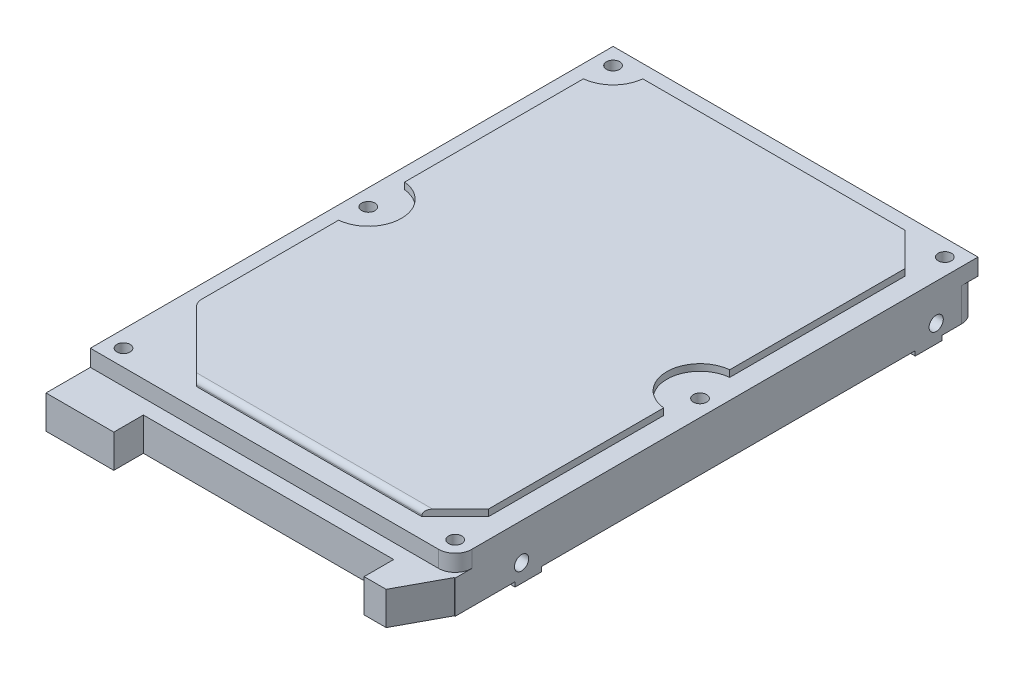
ISO-10303-21;
HEADER;
FILE_DESCRIPTION(('STEP AP214'),'2;1');
FILE_NAME('part.step','',(''),(''),'','','');
FILE_SCHEMA(('AUTOMOTIVE_DESIGN { 1 0 10303 214 1 1 1 1 }'));
ENDSEC;
DATA;
#1=APPLICATION_CONTEXT('core data for automotive mechanical design processes');
#2=APPLICATION_PROTOCOL_DEFINITION('international standard','automotive_design',2000,#1);
#3=PRODUCT_CONTEXT('',#1,'mechanical');
#4=PRODUCT('Part','Part','',(#3));
#5=PRODUCT_RELATED_PRODUCT_CATEGORY('part','',(#4));
#6=PRODUCT_DEFINITION_FORMATION('','',#4);
#7=PRODUCT_DEFINITION_CONTEXT('part definition',#1,'design');
#8=PRODUCT_DEFINITION('design','',#6,#7);
#9=PRODUCT_DEFINITION_SHAPE('','',#8);
#10=(LENGTH_UNIT() NAMED_UNIT(*) SI_UNIT(.MILLI.,.METRE.));
#11=(NAMED_UNIT(*) PLANE_ANGLE_UNIT() SI_UNIT($,.RADIAN.));
#12=(NAMED_UNIT(*) SI_UNIT($,.STERADIAN.) SOLID_ANGLE_UNIT());
#13=UNCERTAINTY_MEASURE_WITH_UNIT(LENGTH_MEASURE(1.E-05),#10,'distance_accuracy_value','');
#14=(GEOMETRIC_REPRESENTATION_CONTEXT(3) GLOBAL_UNCERTAINTY_ASSIGNED_CONTEXT((#13)) GLOBAL_UNIT_ASSIGNED_CONTEXT((#10,
#11,#12)) REPRESENTATION_CONTEXT('',''));
#15=CARTESIAN_POINT('',(0.,0.,0.));
#16=DIRECTION('',(0.,0.,1.));
#17=DIRECTION('',(1.,0.,0.));
#18=AXIS2_PLACEMENT_3D('',#15,#16,#17);
#19=CARTESIAN_POINT('',(0.,-3.175,0.));
#20=DIRECTION('',(0.,0.,1.));
#21=DIRECTION('',(1.,0.,0.));
#22=AXIS2_PLACEMENT_3D('',#19,#20,#21);
#23=PLANE('',#22);
#24=DIRECTION('',(0.,1.,0.));
#25=VECTOR('',#24,1.);
#26=CARTESIAN_POINT('',(0.,-3.175,0.));
#27=LINE('',#26,#25);
#28=CARTESIAN_POINT('',(0.,-3.175,0.));
#29=VERTEX_POINT('',#28);
#30=CARTESIAN_POINT('',(0.,0.,0.));
#31=VERTEX_POINT('',#30);
#32=EDGE_CURVE('E58',#29,#31,#27,.T.);
#33=ORIENTED_EDGE('',*,*,#32,.F.);
#34=DIRECTION('',(-1.,0.,0.));
#35=VECTOR('',#34,1.);
#36=CARTESIAN_POINT('',(0.,-3.175,0.));
#37=LINE('',#36,#35);
#38=CARTESIAN_POINT('',(66.675,-3.175,0.));
#39=VERTEX_POINT('',#38);
#40=EDGE_CURVE('E403',#39,#29,#37,.T.);
#41=ORIENTED_EDGE('',*,*,#40,.F.);
#42=DIRECTION('',(0.,-1.,0.));
#43=VECTOR('',#42,1.);
#44=CARTESIAN_POINT('',(66.675,-3.175,0.));
#45=LINE('',#44,#43);
#46=CARTESIAN_POINT('',(66.675,0.,0.));
#47=VERTEX_POINT('',#46);
#48=EDGE_CURVE('E571',#39,#47,#45,.F.);
#49=ORIENTED_EDGE('',*,*,#48,.T.);
#50=DIRECTION('',(1.,0.,0.));
#51=VECTOR('',#50,1.);
#52=CARTESIAN_POINT('',(0.,0.,0.));
#53=LINE('',#52,#51);
#54=EDGE_CURVE('E641',#31,#47,#53,.T.);
#55=ORIENTED_EDGE('',*,*,#54,.F.);
#56=EDGE_LOOP('',(#33,#41,#49,#55));
#57=FACE_BOUND('',#56,.T.);
#58=ADVANCED_FACE('F32',(#57),#23,.T.);
#59=CARTESIAN_POINT('',(3.175,-9.525,-96.901));
#60=DIRECTION('',(0.,-1.,0.));
#61=DIRECTION('',(0.,0.,-1.));
#62=AXIS2_PLACEMENT_3D('',#59,#60,#61);
#63=PLANE('',#62);
#64=CARTESIAN_POINT('',(65.785,-9.525,-90.6));
#65=DIRECTION('',(0.,-1.,0.));
#66=DIRECTION('',(0.,0.,-1.));
#67=AXIS2_PLACEMENT_3D('',#64,#65,#66);
#68=CIRCLE('',#67,2.54);
#69=CARTESIAN_POINT('',(65.785,-9.525,-88.06));
#70=VERTEX_POINT('',#69);
#71=CARTESIAN_POINT('',(65.785,-9.525,-93.14));
#72=VERTEX_POINT('',#71);
#73=EDGE_CURVE('E419',#70,#72,#68,.T.);
#74=ORIENTED_EDGE('',*,*,#73,.F.);
#75=DIRECTION('',(-1.,0.,0.));
#76=VECTOR('',#75,1.);
#77=CARTESIAN_POINT('',(65.785,-9.525,-88.06));
#78=LINE('',#77,#76);
#79=CARTESIAN_POINT('',(69.85,-9.525,-88.06));
#80=VERTEX_POINT('',#79);
#81=EDGE_CURVE('E402',#80,#70,#78,.T.);
#82=ORIENTED_EDGE('',*,*,#81,.F.);
#83=DIRECTION('',(0.,0.,1.));
#84=VECTOR('',#83,1.);
#85=CARTESIAN_POINT('',(69.85,-9.525,0.));
#86=LINE('',#85,#84);
#87=CARTESIAN_POINT('',(69.85,-9.525,-16.54));
#88=VERTEX_POINT('',#87);
#89=EDGE_CURVE('E1656',#80,#88,#86,.T.);
#90=ORIENTED_EDGE('',*,*,#89,.T.);
#91=DIRECTION('',(1.,0.,0.));
#92=VECTOR('',#91,1.);
#93=CARTESIAN_POINT('',(69.85,-9.525,-16.54));
#94=LINE('',#93,#92);
#95=CARTESIAN_POINT('',(65.785,-9.525,-16.54));
#96=VERTEX_POINT('',#95);
#97=EDGE_CURVE('E440',#96,#88,#94,.T.);
#98=ORIENTED_EDGE('',*,*,#97,.F.);
#99=CARTESIAN_POINT('',(65.785,-9.525,-14.));
#100=DIRECTION('',(0.,-1.,0.));
#101=DIRECTION('',(0.,0.,-1.));
#102=AXIS2_PLACEMENT_3D('',#99,#100,#101);
#103=CIRCLE('',#102,2.54);
#104=CARTESIAN_POINT('',(65.785,-9.525,-11.46));
#105=VERTEX_POINT('',#104);
#106=EDGE_CURVE('E449',#105,#96,#103,.T.);
#107=ORIENTED_EDGE('',*,*,#106,.F.);
#108=DIRECTION('',(-1.,0.,0.));
#109=VECTOR('',#108,1.);
#110=CARTESIAN_POINT('',(65.785,-9.525,-11.46));
#111=LINE('',#110,#109);
#112=CARTESIAN_POINT('',(69.85,-9.525,-11.46));
#113=VERTEX_POINT('',#112);
#114=EDGE_CURVE('E435',#113,#105,#111,.T.);
#115=ORIENTED_EDGE('',*,*,#114,.F.);
#116=CARTESIAN_POINT('',(69.85,-9.525,0.));
#117=VERTEX_POINT('',#116);
#118=EDGE_CURVE('E1654',#113,#117,#86,.T.);
#119=ORIENTED_EDGE('',*,*,#118,.T.);
#120=DIRECTION('',(-1.,0.,0.));
#121=VECTOR('',#120,1.);
#122=CARTESIAN_POINT('',(0.,-9.525,0.));
#123=LINE('',#122,#121);
#124=CARTESIAN_POINT('',(69.6836053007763,-9.525,0.));
#125=VERTEX_POINT('',#124);
#126=EDGE_CURVE('E369',#117,#125,#123,.T.);
#127=ORIENTED_EDGE('',*,*,#126,.T.);
#128=DIRECTION('',(-0.474414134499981,0.,0.880301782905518));
#129=VECTOR('',#128,1.);
#130=CARTESIAN_POINT('',(69.6836053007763,-9.525,0.));
#131=LINE('',#130,#129);
#132=CARTESIAN_POINT('',(65.1116053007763,-9.525,8.4836));
#133=VERTEX_POINT('',#132);
#134=EDGE_CURVE('E352',#125,#133,#131,.T.);
#135=ORIENTED_EDGE('',*,*,#134,.T.);
#136=DIRECTION('',(-1.,0.,0.));
#137=VECTOR('',#136,1.);
#138=CARTESIAN_POINT('',(65.1116053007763,-9.525,8.4836));
#139=LINE('',#138,#137);
#140=CARTESIAN_POINT('',(60.8952053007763,-9.525,8.4836));
#141=VERTEX_POINT('',#140);
#142=EDGE_CURVE('E360',#133,#141,#139,.T.);
#143=ORIENTED_EDGE('',*,*,#142,.T.);
#144=DIRECTION('',(0.,0.,-1.));
#145=VECTOR('',#144,1.);
#146=CARTESIAN_POINT('',(60.8952053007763,-9.525,8.4836));
#147=LINE('',#146,#145);
#148=CARTESIAN_POINT('',(60.8952053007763,-9.525,2.8194));
#149=VERTEX_POINT('',#148);
#150=EDGE_CURVE('E366',#141,#149,#147,.T.);
#151=ORIENTED_EDGE('',*,*,#150,.T.);
#152=DIRECTION('',(-1.,0.,0.));
#153=VECTOR('',#152,1.);
#154=CARTESIAN_POINT('',(60.8952053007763,-9.525,2.8194));
#155=LINE('',#154,#153);
#156=CARTESIAN_POINT('',(12.9794,-9.525,2.8194));
#157=VERTEX_POINT('',#156);
#158=EDGE_CURVE('E380',#149,#157,#155,.T.);
#159=ORIENTED_EDGE('',*,*,#158,.T.);
#160=DIRECTION('',(0.,0.,1.));
#161=VECTOR('',#160,1.);
#162=CARTESIAN_POINT('',(12.9794,-9.525,2.8194));
#163=LINE('',#162,#161);
#164=CARTESIAN_POINT('',(12.9794,-9.525,8.4836));
#165=VERTEX_POINT('',#164);
#166=EDGE_CURVE('E383',#157,#165,#163,.T.);
#167=ORIENTED_EDGE('',*,*,#166,.T.);
#168=DIRECTION('',(-1.,0.,0.));
#169=VECTOR('',#168,1.);
#170=CARTESIAN_POINT('',(12.9794,-9.525,8.4836));
#171=LINE('',#170,#169);
#172=CARTESIAN_POINT('',(0.,-9.525,8.4836));
#173=VERTEX_POINT('',#172);
#174=EDGE_CURVE('E386',#165,#173,#171,.T.);
#175=ORIENTED_EDGE('',*,*,#174,.T.);
#176=DIRECTION('',(0.,0.,-1.));
#177=VECTOR('',#176,1.);
#178=CARTESIAN_POINT('',(0.,-9.525,-96.901));
#179=LINE('',#178,#177);
#180=CARTESIAN_POINT('',(0.,-9.525,-11.46));
#181=VERTEX_POINT('',#180);
#182=EDGE_CURVE('E539',#173,#181,#179,.T.);
#183=ORIENTED_EDGE('',*,*,#182,.T.);
#184=DIRECTION('',(-1.,0.,0.));
#185=VECTOR('',#184,1.);
#186=CARTESIAN_POINT('',(0.,-9.525,-11.46));
#187=LINE('',#186,#185);
#188=CARTESIAN_POINT('',(4.065,-9.525,-11.46));
#189=VERTEX_POINT('',#188);
#190=EDGE_CURVE('E470',#189,#181,#187,.T.);
#191=ORIENTED_EDGE('',*,*,#190,.F.);
#192=CARTESIAN_POINT('',(4.065,-9.525,-14.));
#193=DIRECTION('',(0.,-1.,0.));
#194=DIRECTION('',(0.,0.,-1.));
#195=AXIS2_PLACEMENT_3D('',#192,#193,#194);
#196=CIRCLE('',#195,2.54);
#197=CARTESIAN_POINT('',(4.065,-9.525,-16.54));
#198=VERTEX_POINT('',#197);
#199=EDGE_CURVE('E479',#198,#189,#196,.T.);
#200=ORIENTED_EDGE('',*,*,#199,.F.);
#201=DIRECTION('',(1.,0.,0.));
#202=VECTOR('',#201,1.);
#203=CARTESIAN_POINT('',(4.065,-9.525,-16.54));
#204=LINE('',#203,#202);
#205=CARTESIAN_POINT('',(0.,-9.525,-16.54));
#206=VERTEX_POINT('',#205);
#207=EDGE_CURVE('E465',#206,#198,#204,.T.);
#208=ORIENTED_EDGE('',*,*,#207,.F.);
#209=CARTESIAN_POINT('',(0.,-9.525,-88.06));
#210=VERTEX_POINT('',#209);
#211=EDGE_CURVE('E36',#206,#210,#179,.T.);
#212=ORIENTED_EDGE('',*,*,#211,.T.);
#213=DIRECTION('',(-1.,0.,0.));
#214=VECTOR('',#213,1.);
#215=CARTESIAN_POINT('',(0.,-9.525,-88.06));
#216=LINE('',#215,#214);
#217=CARTESIAN_POINT('',(4.065,-9.525,-88.06));
#218=VERTEX_POINT('',#217);
#219=EDGE_CURVE('E500',#218,#210,#216,.T.);
#220=ORIENTED_EDGE('',*,*,#219,.F.);
#221=CARTESIAN_POINT('',(4.065,-9.525,-90.6));
#222=DIRECTION('',(0.,-1.,0.));
#223=DIRECTION('',(0.,0.,-1.));
#224=AXIS2_PLACEMENT_3D('',#221,#222,#223);
#225=CIRCLE('',#224,2.54);
#226=CARTESIAN_POINT('',(4.065,-9.525,-93.14));
#227=VERTEX_POINT('',#226);
#228=EDGE_CURVE('E507',#227,#218,#225,.T.);
#229=ORIENTED_EDGE('',*,*,#228,.F.);
#230=DIRECTION('',(1.,0.,0.));
#231=VECTOR('',#230,1.);
#232=CARTESIAN_POINT('',(4.065,-9.525,-93.14));
#233=LINE('',#232,#231);
#234=CARTESIAN_POINT('',(0.,-9.525,-93.14));
#235=VERTEX_POINT('',#234);
#236=EDGE_CURVE('E495',#235,#227,#233,.T.);
#237=ORIENTED_EDGE('',*,*,#236,.F.);
#238=CARTESIAN_POINT('',(0.,-9.525,-96.901));
#239=VERTEX_POINT('',#238);
#240=EDGE_CURVE('E537',#235,#239,#179,.T.);
#241=ORIENTED_EDGE('',*,*,#240,.T.);
#242=CARTESIAN_POINT('',(3.175,-9.525,-96.901));
#243=DIRECTION('',(0.,-1.,0.));
#244=DIRECTION('',(0.,0.,-1.));
#245=AXIS2_PLACEMENT_3D('',#242,#243,#244);
#246=CIRCLE('',#245,3.175);
#247=CARTESIAN_POINT('',(3.175,-9.525,-100.076));
#248=VERTEX_POINT('',#247);
#249=EDGE_CURVE('E785',#239,#248,#246,.T.);
#250=ORIENTED_EDGE('',*,*,#249,.T.);
#251=DIRECTION('',(1.,0.,0.));
#252=VECTOR('',#251,1.);
#253=CARTESIAN_POINT('',(66.675,-9.525,-100.076));
#254=LINE('',#253,#252);
#255=CARTESIAN_POINT('',(66.675,-9.525,-100.076));
#256=VERTEX_POINT('',#255);
#257=EDGE_CURVE('E788',#248,#256,#254,.T.);
#258=ORIENTED_EDGE('',*,*,#257,.T.);
#259=CARTESIAN_POINT('',(66.675,-9.525,-96.901));
#260=DIRECTION('',(0.,-1.,0.));
#261=DIRECTION('',(0.,0.,-1.));
#262=AXIS2_PLACEMENT_3D('',#259,#260,#261);
#263=CIRCLE('',#262,3.175);
#264=CARTESIAN_POINT('',(69.85,-9.525,-96.901));
#265=VERTEX_POINT('',#264);
#266=EDGE_CURVE('E1651',#256,#265,#263,.T.);
#267=ORIENTED_EDGE('',*,*,#266,.T.);
#268=CARTESIAN_POINT('',(69.85,-9.525,-93.14));
#269=VERTEX_POINT('',#268);
#270=EDGE_CURVE('E1657',#265,#269,#86,.T.);
#271=ORIENTED_EDGE('',*,*,#270,.T.);
#272=DIRECTION('',(1.,0.,0.));
#273=VECTOR('',#272,1.);
#274=CARTESIAN_POINT('',(69.85,-9.525,-93.14));
#275=LINE('',#274,#273);
#276=EDGE_CURVE('E410',#72,#269,#275,.T.);
#277=ORIENTED_EDGE('',*,*,#276,.F.);
#278=EDGE_LOOP('',(#74,#82,#90,#98,#107,#115,#119,#127,#135,#143,#151,#159,#167,#175,#183,#191,
#200,#208,#212,#220,#229,#237,#241,#250,#258,#267,#271,#277));
#279=FACE_BOUND('',#278,.T.);
#280=ADVANCED_FACE('F368',(#279),#63,.T.);
#281=CARTESIAN_POINT('',(0.,-3.175,0.));
#282=DIRECTION('',(0.,1.,0.));
#283=DIRECTION('',(0.,0.,1.));
#284=AXIS2_PLACEMENT_3D('',#281,#282,#283);
#285=PLANE('',#284);
#286=CARTESIAN_POINT('',(3.175,-3.175,-96.901));
#287=DIRECTION('',(0.,-1.,0.));
#288=DIRECTION('',(0.,0.,-1.));
#289=AXIS2_PLACEMENT_3D('',#286,#287,#288);
#290=CIRCLE('',#289,3.175);
#291=CARTESIAN_POINT('',(0.,-3.175,-96.901));
#292=VERTEX_POINT('',#291);
#293=CARTESIAN_POINT('',(3.175,-3.175,-100.076));
#294=VERTEX_POINT('',#293);
#295=EDGE_CURVE('E552',#292,#294,#290,.T.);
#296=ORIENTED_EDGE('',*,*,#295,.F.);
#297=DIRECTION('',(0.,0.,1.));
#298=VECTOR('',#297,1.);
#299=CARTESIAN_POINT('',(0.,-3.175,-100.076));
#300=LINE('',#299,#298);
#301=CARTESIAN_POINT('',(0.,-3.175,-100.076));
#302=VERTEX_POINT('',#301);
#303=EDGE_CURVE('E597',#302,#292,#300,.T.);
#304=ORIENTED_EDGE('',*,*,#303,.F.);
#305=DIRECTION('',(-1.,0.,0.));
#306=VECTOR('',#305,1.);
#307=CARTESIAN_POINT('',(69.85,-3.175,-100.076));
#308=LINE('',#307,#306);
#309=EDGE_CURVE('E596',#294,#302,#308,.T.);
#310=ORIENTED_EDGE('',*,*,#309,.F.);
#311=EDGE_LOOP('',(#296,#304,#310));
#312=FACE_BOUND('',#311,.T.);
#313=ADVANCED_FACE('F636',(#312),#285,.F.);
#314=CARTESIAN_POINT('',(66.675,-3.175,-96.901));
#315=DIRECTION('',(0.,-1.,0.));
#316=DIRECTION('',(0.,0.,-1.));
#317=AXIS2_PLACEMENT_3D('',#314,#315,#316);
#318=CIRCLE('',#317,3.175);
#319=CARTESIAN_POINT('',(66.675,-3.175,-100.076));
#320=VERTEX_POINT('',#319);
#321=CARTESIAN_POINT('',(69.85,-3.175,-96.901));
#322=VERTEX_POINT('',#321);
#323=EDGE_CURVE('E556',#320,#322,#318,.T.);
#324=ORIENTED_EDGE('',*,*,#323,.F.);
#325=CARTESIAN_POINT('',(69.85,-3.175,-100.076));
#326=VERTEX_POINT('',#325);
#327=EDGE_CURVE('E611',#326,#320,#308,.T.);
#328=ORIENTED_EDGE('',*,*,#327,.F.);
#329=DIRECTION('',(0.,0.,-1.));
#330=VECTOR('',#329,1.);
#331=CARTESIAN_POINT('',(69.85,-3.175,0.));
#332=LINE('',#331,#330);
#333=EDGE_CURVE('E593',#322,#326,#332,.T.);
#334=ORIENTED_EDGE('',*,*,#333,.F.);
#335=EDGE_LOOP('',(#324,#328,#334));
#336=FACE_BOUND('',#335,.T.);
#337=ADVANCED_FACE('F652',(#336),#285,.F.);
#338=CARTESIAN_POINT('',(3.175,0.254,-4.826));
#339=DIRECTION('',(-1.,0.,0.));
#340=DIRECTION('',(0.,0.,1.));
#341=AXIS2_PLACEMENT_3D('',#338,#339,#340);
#342=CYLINDRICAL_SURFACE('',#341,1.016);
#343=DIRECTION('',(1.,0.,0.));
#344=VECTOR('',#343,1.);
#345=CARTESIAN_POINT('',(3.175,1.27,-4.826));
#346=LINE('',#345,#344);
#347=CARTESIAN_POINT('',(15.494,1.27,-4.826));
#348=VERTEX_POINT('',#347);
#349=CARTESIAN_POINT('',(60.706,1.27,-4.826));
#350=VERTEX_POINT('',#349);
#351=EDGE_CURVE('E586',#348,#350,#346,.T.);
#352=ORIENTED_EDGE('',*,*,#351,.F.);
#353=CARTESIAN_POINT('',(15.494,0.254,-4.826));
#354=DIRECTION('',(0.707106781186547,0.,-0.707106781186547));
#355=DIRECTION('',(-0.707106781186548,0.,-0.707106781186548));
#356=AXIS2_PLACEMENT_3D('',#353,#354,#355);
#357=ELLIPSE('',#356,1.43684097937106,1.016);
#358=CARTESIAN_POINT('',(16.51,0.254,-3.81));
#359=VERTEX_POINT('',#358);
#360=EDGE_CURVE('E42',#359,#348,#357,.F.);
#361=ORIENTED_EDGE('',*,*,#360,.F.);
#362=DIRECTION('',(1.,0.,0.));
#363=VECTOR('',#362,1.);
#364=CARTESIAN_POINT('',(3.175,0.254,-3.81));
#365=LINE('',#364,#363);
#366=CARTESIAN_POINT('',(59.69,0.254,-3.81));
#367=VERTEX_POINT('',#366);
#368=EDGE_CURVE('E589',#367,#359,#365,.F.);
#369=ORIENTED_EDGE('',*,*,#368,.F.);
#370=CARTESIAN_POINT('',(60.706,0.254,-4.826));
#371=DIRECTION('',(-0.707106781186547,0.,-0.707106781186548));
#372=DIRECTION('',(-0.707106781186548,0.,0.707106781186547));
#373=AXIS2_PLACEMENT_3D('',#370,#371,#372);
#374=ELLIPSE('',#373,1.43684097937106,1.016);
#375=EDGE_CURVE('E11',#350,#367,#374,.F.);
#376=ORIENTED_EDGE('',*,*,#375,.F.);
#377=EDGE_LOOP('',(#352,#361,#369,#376));
#378=FACE_BOUND('',#377,.T.);
#379=ADVANCED_FACE('F34',(#378),#342,.T.);
#380=CARTESIAN_POINT('',(6.35,1.27,-17.5621024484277));
#381=DIRECTION('',(0.,-1.,0.));
#382=DIRECTION('',(0.,0.,-1.));
#383=AXIS2_PLACEMENT_3D('',#380,#381,#382);
#384=CYLINDRICAL_SURFACE('',#383,2.54);
#385=DIRECTION('',(0.,-1.,0.));
#386=VECTOR('',#385,1.);
#387=CARTESIAN_POINT('',(4.55394877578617,1.27,-15.7660512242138));
#388=LINE('',#387,#386);
#389=CARTESIAN_POINT('',(4.55394877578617,1.27,-15.7660512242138));
#390=VERTEX_POINT('',#389);
#391=CARTESIAN_POINT('',(4.55394877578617,0.,-15.7660512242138));
#392=VERTEX_POINT('',#391);
#393=EDGE_CURVE('E569',#390,#392,#388,.T.);
#394=ORIENTED_EDGE('',*,*,#393,.F.);
#395=CARTESIAN_POINT('',(6.35,1.27,-17.5621024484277));
#396=DIRECTION('',(0.,1.,0.));
#397=DIRECTION('',(0.,0.,1.));
#398=AXIS2_PLACEMENT_3D('',#395,#396,#397);
#399=CIRCLE('',#398,2.54);
#400=CARTESIAN_POINT('',(3.81,1.27,-17.5621024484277));
#401=VERTEX_POINT('',#400);
#402=EDGE_CURVE('E582',#401,#390,#399,.T.);
#403=ORIENTED_EDGE('',*,*,#402,.F.);
#404=DIRECTION('',(0.,-1.,0.));
#405=VECTOR('',#404,1.);
#406=CARTESIAN_POINT('',(3.81,1.27,-17.5621024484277));
#407=LINE('',#406,#405);
#408=CARTESIAN_POINT('',(3.81,0.,-17.5621024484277));
#409=VERTEX_POINT('',#408);
#410=EDGE_CURVE('E579',#409,#401,#407,.F.);
#411=ORIENTED_EDGE('',*,*,#410,.F.);
#412=CARTESIAN_POINT('',(6.35,0.,-17.5621024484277));
#413=DIRECTION('',(0.,1.,0.));
#414=DIRECTION('',(0.,0.,1.));
#415=AXIS2_PLACEMENT_3D('',#412,#413,#414);
#416=CIRCLE('',#415,2.54);
#417=EDGE_CURVE('E584',#409,#392,#416,.T.);
#418=ORIENTED_EDGE('',*,*,#417,.T.);
#419=EDGE_LOOP('',(#394,#403,#411,#418));
#420=FACE_BOUND('',#419,.T.);
#421=ADVANCED_FACE('F841',(#420),#384,.T.);
#422=CARTESIAN_POINT('',(0.,0.,0.));
#423=DIRECTION('',(0.,1.,0.));
#424=DIRECTION('',(0.,0.,1.));
#425=AXIS2_PLACEMENT_3D('',#422,#423,#424);
#426=PLANE('',#425);
#427=ORIENTED_EDGE('',*,*,#54,.T.);
#428=CARTESIAN_POINT('',(66.675,0.,-3.175));
#429=DIRECTION('',(0.,1.,0.));
#430=DIRECTION('',(0.,0.,1.));
#431=AXIS2_PLACEMENT_3D('',#428,#429,#430);
#432=CIRCLE('',#431,3.175);
#433=CARTESIAN_POINT('',(69.85,0.,-3.175));
#434=VERTEX_POINT('',#433);
#435=EDGE_CURVE('E570',#47,#434,#432,.T.);
#436=ORIENTED_EDGE('',*,*,#435,.T.);
#437=DIRECTION('',(0.,0.,-1.));
#438=VECTOR('',#437,1.);
#439=CARTESIAN_POINT('',(69.85,0.,0.));
#440=LINE('',#439,#438);
#441=CARTESIAN_POINT('',(69.85,0.,-100.076));
#442=VERTEX_POINT('',#441);
#443=EDGE_CURVE('E638',#434,#442,#440,.T.);
#444=ORIENTED_EDGE('',*,*,#443,.T.);
#445=DIRECTION('',(-1.,0.,0.));
#446=VECTOR('',#445,1.);
#447=CARTESIAN_POINT('',(69.85,0.,-100.076));
#448=LINE('',#447,#446);
#449=CARTESIAN_POINT('',(0.,0.,-100.076));
#450=VERTEX_POINT('',#449);
#451=EDGE_CURVE('E637',#442,#450,#448,.T.);
#452=ORIENTED_EDGE('',*,*,#451,.T.);
#453=DIRECTION('',(0.,0.,1.));
#454=VECTOR('',#453,1.);
#455=CARTESIAN_POINT('',(0.,0.,-100.076));
#456=LINE('',#455,#454);
#457=EDGE_CURVE('E606',#450,#31,#456,.T.);
#458=ORIENTED_EDGE('',*,*,#457,.T.);
#459=EDGE_LOOP('',(#427,#436,#444,#452,#458));
#460=FACE_BOUND('',#459,.T.);
#461=CARTESIAN_POINT('',(3.175,0.,-96.901));
#462=DIRECTION('',(0.,1.,0.));
#463=DIRECTION('',(0.,0.,1.));
#464=AXIS2_PLACEMENT_3D('',#461,#462,#463);
#465=CIRCLE('',#464,1.27);
#466=CARTESIAN_POINT('',(3.175,0.,-95.631));
#467=VERTEX_POINT('',#466);
#468=EDGE_CURVE('E764',#467,#467,#465,.T.);
#469=ORIENTED_EDGE('',*,*,#468,.F.);
#470=EDGE_LOOP('',(#469));
#471=FACE_BOUND('',#470,.T.);
#472=CARTESIAN_POINT('',(66.675,0.,-96.901));
#473=DIRECTION('',(0.,1.,0.));
#474=DIRECTION('',(0.,0.,1.));
#475=AXIS2_PLACEMENT_3D('',#472,#473,#474);
#476=CIRCLE('',#475,1.26999999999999);
#477=CARTESIAN_POINT('',(66.675,0.,-95.631));
#478=VERTEX_POINT('',#477);
#479=EDGE_CURVE('E758',#478,#478,#476,.T.);
#480=ORIENTED_EDGE('',*,*,#479,.F.);
#481=EDGE_LOOP('',(#480));
#482=FACE_BOUND('',#481,.T.);
#483=CARTESIAN_POINT('',(3.175,0.,-50.038));
#484=DIRECTION('',(0.,1.,0.));
#485=DIRECTION('',(0.,0.,1.));
#486=AXIS2_PLACEMENT_3D('',#483,#484,#485);
#487=CIRCLE('',#486,1.27);
#488=CARTESIAN_POINT('',(3.175,0.,-48.768));
#489=VERTEX_POINT('',#488);
#490=EDGE_CURVE('E752',#489,#489,#487,.T.);
#491=ORIENTED_EDGE('',*,*,#490,.F.);
#492=EDGE_LOOP('',(#491));
#493=FACE_BOUND('',#492,.T.);
#494=CARTESIAN_POINT('',(66.675,0.,-50.038));
#495=DIRECTION('',(0.,1.,0.));
#496=DIRECTION('',(0.,0.,1.));
#497=AXIS2_PLACEMENT_3D('',#494,#495,#496);
#498=CIRCLE('',#497,1.26999999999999);
#499=CARTESIAN_POINT('',(66.675,0.,-48.768));
#500=VERTEX_POINT('',#499);
#501=EDGE_CURVE('E746',#500,#500,#498,.T.);
#502=ORIENTED_EDGE('',*,*,#501,.F.);
#503=EDGE_LOOP('',(#502));
#504=FACE_BOUND('',#503,.T.);
#505=CARTESIAN_POINT('',(3.175,0.,-3.175));
#506=DIRECTION('',(0.,1.,0.));
#507=DIRECTION('',(0.,0.,1.));
#508=AXIS2_PLACEMENT_3D('',#505,#506,#507);
#509=CIRCLE('',#508,1.27);
#510=CARTESIAN_POINT('',(3.175,0.,-1.905));
#511=VERTEX_POINT('',#510);
#512=EDGE_CURVE('E740',#511,#511,#509,.T.);
#513=ORIENTED_EDGE('',*,*,#512,.F.);
#514=EDGE_LOOP('',(#513));
#515=FACE_BOUND('',#514,.T.);
#516=CARTESIAN_POINT('',(66.675,0.,-3.175));
#517=DIRECTION('',(0.,1.,0.));
#518=DIRECTION('',(0.,0.,1.));
#519=AXIS2_PLACEMENT_3D('',#516,#517,#518);
#520=CIRCLE('',#519,1.26999999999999);
#521=CARTESIAN_POINT('',(66.675,0.,-1.90500000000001));
#522=VERTEX_POINT('',#521);
#523=EDGE_CURVE('E734',#522,#522,#520,.T.);
#524=ORIENTED_EDGE('',*,*,#523,.F.);
#525=EDGE_LOOP('',(#524));
#526=FACE_BOUND('',#525,.T.);
#527=DIRECTION('',(0.,0.,1.));
#528=VECTOR('',#527,1.);
#529=CARTESIAN_POINT('',(3.81,0.,-56.356170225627));
#530=LINE('',#529,#528);
#531=CARTESIAN_POINT('',(3.81,0.,-90.582829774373));
#532=VERTEX_POINT('',#531);
#533=CARTESIAN_POINT('',(3.81,0.,-56.356170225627));
#534=VERTEX_POINT('',#533);
#535=EDGE_CURVE('E669',#532,#534,#530,.T.);
#536=ORIENTED_EDGE('',*,*,#535,.F.);
#537=CARTESIAN_POINT('',(3.175,0.,-96.901));
#538=DIRECTION('',(0.,-1.,0.));
#539=DIRECTION('',(0.,0.,1.));
#540=AXIS2_PLACEMENT_3D('',#537,#538,#539);
#541=CIRCLE('',#540,6.35);
#542=CARTESIAN_POINT('',(9.49317022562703,0.,-96.266));
#543=VERTEX_POINT('',#542);
#544=EDGE_CURVE('E667',#543,#532,#541,.T.);
#545=ORIENTED_EDGE('',*,*,#544,.F.);
#546=DIRECTION('',(-1.,0.,0.));
#547=VECTOR('',#546,1.);
#548=CARTESIAN_POINT('',(9.49317022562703,0.,-96.266));
#549=LINE('',#548,#547);
#550=CARTESIAN_POINT('',(59.69,0.,-96.266));
#551=VERTEX_POINT('',#550);
#552=EDGE_CURVE('E703',#551,#543,#549,.T.);
#553=ORIENTED_EDGE('',*,*,#552,.F.);
#554=DIRECTION('',(-0.707106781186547,0.,-0.707106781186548));
#555=VECTOR('',#554,1.);
#556=CARTESIAN_POINT('',(59.69,0.,-96.266));
#557=LINE('',#556,#555);
#558=CARTESIAN_POINT('',(66.04,0.,-89.916));
#559=VERTEX_POINT('',#558);
#560=EDGE_CURVE('E700',#559,#551,#557,.T.);
#561=ORIENTED_EDGE('',*,*,#560,.F.);
#562=DIRECTION('',(0.,0.,-1.));
#563=VECTOR('',#562,1.);
#564=CARTESIAN_POINT('',(66.04,0.,-89.916));
#565=LINE('',#564,#563);
#566=CARTESIAN_POINT('',(66.04,0.,-56.356170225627));
#567=VERTEX_POINT('',#566);
#568=EDGE_CURVE('E698',#567,#559,#565,.T.);
#569=ORIENTED_EDGE('',*,*,#568,.F.);
#570=CARTESIAN_POINT('',(66.675,0.,-50.038));
#571=DIRECTION('',(0.,-1.,0.));
#572=DIRECTION('',(0.,0.,1.));
#573=AXIS2_PLACEMENT_3D('',#570,#571,#572);
#574=CIRCLE('',#573,6.35);
#575=CARTESIAN_POINT('',(66.04,0.,-43.719829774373));
#576=VERTEX_POINT('',#575);
#577=EDGE_CURVE('E696',#576,#567,#574,.T.);
#578=ORIENTED_EDGE('',*,*,#577,.F.);
#579=DIRECTION('',(0.,0.,-1.));
#580=VECTOR('',#579,1.);
#581=CARTESIAN_POINT('',(66.04,0.,-43.719829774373));
#582=LINE('',#581,#580);
#583=CARTESIAN_POINT('',(66.04,0.,-10.16));
#584=VERTEX_POINT('',#583);
#585=EDGE_CURVE('E694',#584,#576,#582,.T.);
#586=ORIENTED_EDGE('',*,*,#585,.F.);
#587=DIRECTION('',(0.707106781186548,0.,-0.707106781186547));
#588=VECTOR('',#587,1.);
#589=CARTESIAN_POINT('',(66.04,0.,-10.16));
#590=LINE('',#589,#588);
#591=CARTESIAN_POINT('',(59.69,0.,-3.81));
#592=VERTEX_POINT('',#591);
#593=EDGE_CURVE('E692',#592,#584,#590,.T.);
#594=ORIENTED_EDGE('',*,*,#593,.F.);
#595=DIRECTION('',(1.,0.,0.));
#596=VECTOR('',#595,1.);
#597=CARTESIAN_POINT('',(59.69,0.,-3.81));
#598=LINE('',#597,#596);
#599=CARTESIAN_POINT('',(16.51,0.,-3.81));
#600=VERTEX_POINT('',#599);
#601=EDGE_CURVE('E689',#600,#592,#598,.T.);
#602=ORIENTED_EDGE('',*,*,#601,.F.);
#603=DIRECTION('',(0.707106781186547,0.,0.707106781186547));
#604=VECTOR('',#603,1.);
#605=CARTESIAN_POINT('',(3.81,0.,-16.51));
#606=LINE('',#605,#604);
#607=EDGE_CURVE('E686',#392,#600,#606,.T.);
#608=ORIENTED_EDGE('',*,*,#607,.F.);
#609=ORIENTED_EDGE('',*,*,#417,.F.);
#610=DIRECTION('',(0.,0.,1.));
#611=VECTOR('',#610,1.);
#612=CARTESIAN_POINT('',(3.81,0.,-16.51));
#613=LINE('',#612,#611);
#614=CARTESIAN_POINT('',(3.81,0.,-43.719829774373));
#615=VERTEX_POINT('',#614);
#616=EDGE_CURVE('E683',#615,#409,#613,.T.);
#617=ORIENTED_EDGE('',*,*,#616,.F.);
#618=CARTESIAN_POINT('',(3.175,0.,-50.038));
#619=DIRECTION('',(0.,-1.,0.));
#620=DIRECTION('',(0.,0.,1.));
#621=AXIS2_PLACEMENT_3D('',#618,#619,#620);
#622=CIRCLE('',#621,6.35);
#623=EDGE_CURVE('E676',#534,#615,#622,.T.);
#624=ORIENTED_EDGE('',*,*,#623,.F.);
#625=EDGE_LOOP('',(#536,#545,#553,#561,#569,#578,#586,#594,#602,#608,#609,#617,#624));
#626=FACE_BOUND('',#625,.T.);
#627=ADVANCED_FACE('F771',(#460,#471,#482,#493,#504,#515,#526,#626),#426,.T.);
#628=CARTESIAN_POINT('',(66.675,-3.175,-3.175));
#629=DIRECTION('',(0.,-1.,0.));
#630=DIRECTION('',(0.,0.,-1.));
#631=AXIS2_PLACEMENT_3D('',#628,#629,#630);
#632=CYLINDRICAL_SURFACE('',#631,3.175);
#633=DIRECTION('',(0.,-1.,0.));
#634=VECTOR('',#633,1.);
#635=CARTESIAN_POINT('',(69.85,-3.175,-3.175));
#636=LINE('',#635,#634);
#637=CARTESIAN_POINT('',(69.85,-3.175,-3.175));
#638=VERTEX_POINT('',#637);
#639=EDGE_CURVE('E634',#434,#638,#636,.T.);
#640=ORIENTED_EDGE('',*,*,#639,.F.);
#641=ORIENTED_EDGE('',*,*,#435,.F.);
#642=ORIENTED_EDGE('',*,*,#48,.F.);
#643=CARTESIAN_POINT('',(66.675,-3.175,-3.175));
#644=DIRECTION('',(0.,1.,0.));
#645=DIRECTION('',(0.,0.,1.));
#646=AXIS2_PLACEMENT_3D('',#643,#644,#645);
#647=CIRCLE('',#646,3.175);
#648=EDGE_CURVE('E566',#638,#39,#647,.F.);
#649=ORIENTED_EDGE('',*,*,#648,.F.);
#650=EDGE_LOOP('',(#640,#641,#642,#649));
#651=FACE_BOUND('',#650,.T.);
#652=ADVANCED_FACE('F914',(#651),#632,.T.);
#653=CARTESIAN_POINT('',(0.,-3.175,-100.076));
#654=DIRECTION('',(-1.,0.,0.));
#655=DIRECTION('',(0.,0.,1.));
#656=AXIS2_PLACEMENT_3D('',#653,#654,#655);
#657=PLANE('',#656);
#658=CARTESIAN_POINT('',(0.,-6.985,-12.7));
#659=DIRECTION('',(1.,0.,0.));
#660=DIRECTION('',(0.,0.,-1.));
#661=AXIS2_PLACEMENT_3D('',#658,#659,#660);
#662=CIRCLE('',#661,1.3589);
#663=CARTESIAN_POINT('',(0.,-6.985,-14.0589));
#664=VERTEX_POINT('',#663);
#665=EDGE_CURVE('E1685',#664,#664,#662,.T.);
#666=ORIENTED_EDGE('',*,*,#665,.T.);
#667=EDGE_LOOP('',(#666));
#668=FACE_BOUND('',#667,.T.);
#669=CARTESIAN_POINT('',(0.,-6.985,-92.075));
#670=DIRECTION('',(1.,0.,0.));
#671=DIRECTION('',(0.,0.,-1.));
#672=AXIS2_PLACEMENT_3D('',#669,#670,#671);
#673=CIRCLE('',#672,1.3589);
#674=CARTESIAN_POINT('',(0.,-6.985,-93.4339));
#675=VERTEX_POINT('',#674);
#676=EDGE_CURVE('E1679',#675,#675,#673,.T.);
#677=ORIENTED_EDGE('',*,*,#676,.T.);
#678=EDGE_LOOP('',(#677));
#679=FACE_BOUND('',#678,.T.);
#680=DIRECTION('',(0.,1.,0.));
#681=VECTOR('',#680,1.);
#682=CARTESIAN_POINT('',(0.,-9.525,-96.901));
#683=LINE('',#682,#681);
#684=EDGE_CURVE('E560',#239,#292,#683,.T.);
#685=ORIENTED_EDGE('',*,*,#684,.F.);
#686=ORIENTED_EDGE('',*,*,#240,.F.);
#687=DIRECTION('',(0.,1.,0.));
#688=VECTOR('',#687,1.);
#689=CARTESIAN_POINT('',(0.,-10.414,-93.14));
#690=LINE('',#689,#688);
#691=CARTESIAN_POINT('',(0.,-10.414,-93.14));
#692=VERTEX_POINT('',#691);
#693=EDGE_CURVE('E506',#692,#235,#690,.T.);
#694=ORIENTED_EDGE('',*,*,#693,.F.);
#695=DIRECTION('',(0.,0.,-1.));
#696=VECTOR('',#695,1.);
#697=CARTESIAN_POINT('',(0.,-10.414,-93.14));
#698=LINE('',#697,#696);
#699=CARTESIAN_POINT('',(0.,-10.414,-88.06));
#700=VERTEX_POINT('',#699);
#701=EDGE_CURVE('E504',#700,#692,#698,.T.);
#702=ORIENTED_EDGE('',*,*,#701,.F.);
#703=DIRECTION('',(0.,1.,0.));
#704=VECTOR('',#703,1.);
#705=CARTESIAN_POINT('',(0.,-10.414,-88.06));
#706=LINE('',#705,#704);
#707=EDGE_CURVE('E520',#700,#210,#706,.T.);
#708=ORIENTED_EDGE('',*,*,#707,.T.);
#709=ORIENTED_EDGE('',*,*,#211,.F.);
#710=DIRECTION('',(0.,1.,0.));
#711=VECTOR('',#710,1.);
#712=CARTESIAN_POINT('',(0.,-10.414,-16.54));
#713=LINE('',#712,#711);
#714=CARTESIAN_POINT('',(0.,-10.414,-16.54));
#715=VERTEX_POINT('',#714);
#716=EDGE_CURVE('E476',#715,#206,#713,.T.);
#717=ORIENTED_EDGE('',*,*,#716,.F.);
#718=DIRECTION('',(0.,0.,-1.));
#719=VECTOR('',#718,1.);
#720=CARTESIAN_POINT('',(0.,-10.414,-16.54));
#721=LINE('',#720,#719);
#722=CARTESIAN_POINT('',(0.,-10.414,-11.46));
#723=VERTEX_POINT('',#722);
#724=EDGE_CURVE('E474',#723,#715,#721,.T.);
#725=ORIENTED_EDGE('',*,*,#724,.F.);
#726=DIRECTION('',(0.,1.,0.));
#727=VECTOR('',#726,1.);
#728=CARTESIAN_POINT('',(0.,-10.414,-11.46));
#729=LINE('',#728,#727);
#730=EDGE_CURVE('E486',#723,#181,#729,.T.);
#731=ORIENTED_EDGE('',*,*,#730,.T.);
#732=ORIENTED_EDGE('',*,*,#182,.F.);
#733=DIRECTION('',(0.,-1.,0.));
#734=VECTOR('',#733,1.);
#735=CARTESIAN_POINT('',(0.,67.023121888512,8.4836));
#736=LINE('',#735,#734);
#737=CARTESIAN_POINT('',(0.,-3.175,8.4836));
#738=VERTEX_POINT('',#737);
#739=EDGE_CURVE('E389',#738,#173,#736,.T.);
#740=ORIENTED_EDGE('',*,*,#739,.F.);
#741=DIRECTION('',(0.,0.,1.));
#742=VECTOR('',#741,1.);
#743=CARTESIAN_POINT('',(0.,-3.175,8.4836));
#744=LINE('',#743,#742);
#745=EDGE_CURVE('E405',#29,#738,#744,.T.);
#746=ORIENTED_EDGE('',*,*,#745,.F.);
#747=ORIENTED_EDGE('',*,*,#32,.T.);
#748=ORIENTED_EDGE('',*,*,#457,.F.);
#749=DIRECTION('',(0.,1.,0.));
#750=VECTOR('',#749,1.);
#751=CARTESIAN_POINT('',(0.,-3.175,-100.076));
#752=LINE('',#751,#750);
#753=EDGE_CURVE('E623',#302,#450,#752,.T.);
#754=ORIENTED_EDGE('',*,*,#753,.F.);
#755=ORIENTED_EDGE('',*,*,#303,.T.);
#756=EDGE_LOOP('',(#685,#686,#694,#702,#708,#709,#717,#725,#731,#732,#740,#746,#747,#748,#754,#755));
#757=FACE_BOUND('',#756,.T.);
#758=ADVANCED_FACE('F631',(#668,#679,#757),#657,.T.);
#759=CARTESIAN_POINT('',(69.85,-3.175,-100.076));
#760=DIRECTION('',(0.,0.,-1.));
#761=DIRECTION('',(-1.,0.,0.));
#762=AXIS2_PLACEMENT_3D('',#759,#760,#761);
#763=PLANE('',#762);
#764=ORIENTED_EDGE('',*,*,#451,.F.);
#765=DIRECTION('',(0.,1.,0.));
#766=VECTOR('',#765,1.);
#767=CARTESIAN_POINT('',(69.85,-3.175,-100.076));
#768=LINE('',#767,#766);
#769=EDGE_CURVE('E618',#326,#442,#768,.T.);
#770=ORIENTED_EDGE('',*,*,#769,.F.);
#771=ORIENTED_EDGE('',*,*,#327,.T.);
#772=DIRECTION('',(0.,1.,0.));
#773=VECTOR('',#772,1.);
#774=CARTESIAN_POINT('',(66.675,-9.525,-100.076));
#775=LINE('',#774,#773);
#776=EDGE_CURVE('E662',#256,#320,#775,.T.);
#777=ORIENTED_EDGE('',*,*,#776,.F.);
#778=ORIENTED_EDGE('',*,*,#257,.F.);
#779=DIRECTION('',(0.,1.,0.));
#780=VECTOR('',#779,1.);
#781=CARTESIAN_POINT('',(3.175,-9.525,-100.076));
#782=LINE('',#781,#780);
#783=EDGE_CURVE('E626',#248,#294,#782,.T.);
#784=ORIENTED_EDGE('',*,*,#783,.T.);
#785=ORIENTED_EDGE('',*,*,#309,.T.);
#786=ORIENTED_EDGE('',*,*,#753,.T.);
#787=EDGE_LOOP('',(#764,#770,#771,#777,#778,#784,#785,#786));
#788=FACE_BOUND('',#787,.T.);
#789=ADVANCED_FACE('F622',(#788),#763,.T.);
#790=CARTESIAN_POINT('',(69.85,-3.175,0.));
#791=DIRECTION('',(1.,0.,0.));
#792=DIRECTION('',(0.,0.,-1.));
#793=AXIS2_PLACEMENT_3D('',#790,#791,#792);
#794=PLANE('',#793);
#795=CARTESIAN_POINT('',(69.85,-6.985,-92.075));
#796=DIRECTION('',(-1.,0.,0.));
#797=DIRECTION('',(0.,0.,1.));
#798=AXIS2_PLACEMENT_3D('',#795,#796,#797);
#799=CIRCLE('',#798,1.3589);
#800=CARTESIAN_POINT('',(69.85,-6.985,-90.7161));
#801=VERTEX_POINT('',#800);
#802=EDGE_CURVE('E1697',#801,#801,#799,.T.);
#803=ORIENTED_EDGE('',*,*,#802,.T.);
#804=EDGE_LOOP('',(#803));
#805=FACE_BOUND('',#804,.T.);
#806=CARTESIAN_POINT('',(69.85,-6.985,-12.7));
#807=DIRECTION('',(-1.,0.,0.));
#808=DIRECTION('',(0.,0.,1.));
#809=AXIS2_PLACEMENT_3D('',#806,#807,#808);
#810=CIRCLE('',#809,1.3589);
#811=CARTESIAN_POINT('',(69.85,-6.985,-11.3411));
#812=VERTEX_POINT('',#811);
#813=EDGE_CURVE('E1691',#812,#812,#810,.T.);
#814=ORIENTED_EDGE('',*,*,#813,.T.);
#815=EDGE_LOOP('',(#814));
#816=FACE_BOUND('',#815,.T.);
#817=DIRECTION('',(0.,1.,0.));
#818=VECTOR('',#817,1.);
#819=CARTESIAN_POINT('',(69.85,-9.525,0.));
#820=LINE('',#819,#818);
#821=CARTESIAN_POINT('',(69.85,-3.175,0.));
#822=VERTEX_POINT('',#821);
#823=EDGE_CURVE('E563',#117,#822,#820,.T.);
#824=ORIENTED_EDGE('',*,*,#823,.F.);
#825=ORIENTED_EDGE('',*,*,#118,.F.);
#826=DIRECTION('',(0.,1.,0.));
#827=VECTOR('',#826,1.);
#828=CARTESIAN_POINT('',(69.85,-10.414,-11.46));
#829=LINE('',#828,#827);
#830=CARTESIAN_POINT('',(69.85,-10.414,-11.46));
#831=VERTEX_POINT('',#830);
#832=EDGE_CURVE('E446',#831,#113,#829,.T.);
#833=ORIENTED_EDGE('',*,*,#832,.F.);
#834=DIRECTION('',(0.,0.,1.));
#835=VECTOR('',#834,1.);
#836=CARTESIAN_POINT('',(69.85,-10.414,-11.46));
#837=LINE('',#836,#835);
#838=CARTESIAN_POINT('',(69.85,-10.414,-16.54));
#839=VERTEX_POINT('',#838);
#840=EDGE_CURVE('E444',#839,#831,#837,.T.);
#841=ORIENTED_EDGE('',*,*,#840,.F.);
#842=DIRECTION('',(0.,1.,0.));
#843=VECTOR('',#842,1.);
#844=CARTESIAN_POINT('',(69.85,-10.414,-16.54));
#845=LINE('',#844,#843);
#846=EDGE_CURVE('E456',#839,#88,#845,.T.);
#847=ORIENTED_EDGE('',*,*,#846,.T.);
#848=ORIENTED_EDGE('',*,*,#89,.F.);
#849=DIRECTION('',(0.,1.,0.));
#850=VECTOR('',#849,1.);
#851=CARTESIAN_POINT('',(69.85,-10.414,-88.06));
#852=LINE('',#851,#850);
#853=CARTESIAN_POINT('',(69.85,-10.414,-88.06));
#854=VERTEX_POINT('',#853);
#855=EDGE_CURVE('E416',#854,#80,#852,.T.);
#856=ORIENTED_EDGE('',*,*,#855,.F.);
#857=DIRECTION('',(0.,0.,1.));
#858=VECTOR('',#857,1.);
#859=CARTESIAN_POINT('',(69.85,-10.414,-88.06));
#860=LINE('',#859,#858);
#861=CARTESIAN_POINT('',(69.85,-10.414,-93.14));
#862=VERTEX_POINT('',#861);
#863=EDGE_CURVE('E414',#862,#854,#860,.T.);
#864=ORIENTED_EDGE('',*,*,#863,.F.);
#865=DIRECTION('',(0.,1.,0.));
#866=VECTOR('',#865,1.);
#867=CARTESIAN_POINT('',(69.85,-10.414,-93.14));
#868=LINE('',#867,#866);
#869=EDGE_CURVE('E426',#862,#269,#868,.T.);
#870=ORIENTED_EDGE('',*,*,#869,.T.);
#871=ORIENTED_EDGE('',*,*,#270,.F.);
#872=DIRECTION('',(0.,1.,0.));
#873=VECTOR('',#872,1.);
#874=CARTESIAN_POINT('',(69.85,-9.525,-96.901));
#875=LINE('',#874,#873);
#876=EDGE_CURVE('E660',#265,#322,#875,.T.);
#877=ORIENTED_EDGE('',*,*,#876,.T.);
#878=ORIENTED_EDGE('',*,*,#333,.T.);
#879=ORIENTED_EDGE('',*,*,#769,.T.);
#880=ORIENTED_EDGE('',*,*,#443,.F.);
#881=ORIENTED_EDGE('',*,*,#639,.T.);
#882=DIRECTION('',(0.,0.,1.));
#883=VECTOR('',#882,1.);
#884=CARTESIAN_POINT('',(69.85,-3.175,0.));
#885=LINE('',#884,#883);
#886=EDGE_CURVE('E656',#638,#822,#885,.T.);
#887=ORIENTED_EDGE('',*,*,#886,.T.);
#888=EDGE_LOOP('',(#824,#825,#833,#841,#847,#848,#856,#864,#870,#871,#877,#878,#879,#880,#881,#887));
#889=FACE_BOUND('',#888,.T.);
#890=ADVANCED_FACE('F648',(#805,#816,#889),#794,.T.);
#891=DIRECTION('',(0.,-1.,0.));
#892=VECTOR('',#891,1.);
#893=CARTESIAN_POINT('',(69.6836053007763,67.023121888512,0.));
#894=LINE('',#893,#892);
#895=CARTESIAN_POINT('',(69.6836053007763,-3.175,0.));
#896=VERTEX_POINT('',#895);
#897=EDGE_CURVE('E50',#896,#125,#894,.T.);
#898=ORIENTED_EDGE('',*,*,#897,.T.);
#899=ORIENTED_EDGE('',*,*,#126,.F.);
#900=ORIENTED_EDGE('',*,*,#823,.T.);
#901=DIRECTION('',(-1.,0.,0.));
#902=VECTOR('',#901,1.);
#903=CARTESIAN_POINT('',(0.,-3.175,0.));
#904=LINE('',#903,#902);
#905=EDGE_CURVE('E657',#822,#896,#904,.T.);
#906=ORIENTED_EDGE('',*,*,#905,.T.);
#907=EDGE_LOOP('',(#898,#899,#900,#906));
#908=FACE_BOUND('',#907,.T.);
#909=ADVANCED_FACE('F888',(#908),#23,.T.);
#910=CARTESIAN_POINT('',(3.175,-3.4925,-96.901));
#911=DIRECTION('',(0.,1.,0.));
#912=DIRECTION('',(0.,0.,1.));
#913=AXIS2_PLACEMENT_3D('',#910,#911,#912);
#914=CYLINDRICAL_SURFACE('',#913,1.27);
#915=CARTESIAN_POINT('',(3.175,-3.175,-96.901));
#916=DIRECTION('',(0.,1.,0.));
#917=DIRECTION('',(0.,0.,1.));
#918=AXIS2_PLACEMENT_3D('',#915,#916,#917);
#919=CIRCLE('',#918,1.27);
#920=CARTESIAN_POINT('',(3.175,-3.175,-95.631));
#921=VERTEX_POINT('',#920);
#922=EDGE_CURVE('E766',#921,#921,#919,.T.);
#923=CARTESIAN_POINT('',(3.175,0.,-95.631));
#924=CARTESIAN_POINT('',(3.175,-0.0330729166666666,-95.631));
#925=CARTESIAN_POINT('',(3.175,-0.0661458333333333,-95.631));
#926=CARTESIAN_POINT('',(3.175,-0.132291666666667,-95.631));
#927=CARTESIAN_POINT('',(3.175,-0.165364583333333,-95.631));
#928=CARTESIAN_POINT('',(3.175,-0.231510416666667,-95.631));
#929=CARTESIAN_POINT('',(3.175,-0.264583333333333,-95.631));
#930=CARTESIAN_POINT('',(3.175,-0.330729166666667,-95.631));
#931=CARTESIAN_POINT('',(3.175,-0.363802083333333,-95.631));
#932=CARTESIAN_POINT('',(3.175,-0.429947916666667,-95.631));
#933=CARTESIAN_POINT('',(3.175,-0.463020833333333,-95.631));
#934=CARTESIAN_POINT('',(3.175,-0.529166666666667,-95.631));
#935=CARTESIAN_POINT('',(3.175,-0.562239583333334,-95.631));
#936=CARTESIAN_POINT('',(3.175,-0.628385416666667,-95.631));
#937=CARTESIAN_POINT('',(3.175,-0.661458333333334,-95.631));
#938=CARTESIAN_POINT('',(3.175,-0.727604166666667,-95.631));
#939=CARTESIAN_POINT('',(3.175,-0.760677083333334,-95.631));
#940=CARTESIAN_POINT('',(3.175,-0.826822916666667,-95.631));
#941=CARTESIAN_POINT('',(3.175,-0.859895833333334,-95.631));
#942=CARTESIAN_POINT('',(3.175,-0.926041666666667,-95.631));
#943=CARTESIAN_POINT('',(3.175,-0.959114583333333,-95.631));
#944=CARTESIAN_POINT('',(3.175,-1.02526041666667,-95.631));
#945=CARTESIAN_POINT('',(3.175,-1.05833333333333,-95.631));
#946=CARTESIAN_POINT('',(3.175,-1.12447916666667,-95.631));
#947=CARTESIAN_POINT('',(3.175,-1.15755208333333,-95.631));
#948=CARTESIAN_POINT('',(3.175,-1.22369791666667,-95.631));
#949=CARTESIAN_POINT('',(3.175,-1.25677083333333,-95.631));
#950=CARTESIAN_POINT('',(3.175,-1.32291666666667,-95.631));
#951=CARTESIAN_POINT('',(3.175,-1.35598958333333,-95.631));
#952=CARTESIAN_POINT('',(3.175,-1.42213541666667,-95.631));
#953=CARTESIAN_POINT('',(3.175,-1.45520833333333,-95.631));
#954=CARTESIAN_POINT('',(3.175,-1.52135416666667,-95.631));
#955=CARTESIAN_POINT('',(3.175,-1.55442708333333,-95.631));
#956=CARTESIAN_POINT('',(3.175,-1.62057291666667,-95.631));
#957=CARTESIAN_POINT('',(3.175,-1.65364583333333,-95.631));
#958=CARTESIAN_POINT('',(3.175,-1.71979166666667,-95.631));
#959=CARTESIAN_POINT('',(3.175,-1.75286458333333,-95.631));
#960=CARTESIAN_POINT('',(3.175,-1.81901041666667,-95.631));
#961=CARTESIAN_POINT('',(3.175,-1.85208333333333,-95.631));
#962=CARTESIAN_POINT('',(3.175,-1.91822916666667,-95.631));
#963=CARTESIAN_POINT('',(3.175,-1.95130208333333,-95.631));
#964=CARTESIAN_POINT('',(3.175,-2.01744791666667,-95.631));
#965=CARTESIAN_POINT('',(3.175,-2.05052083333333,-95.631));
#966=CARTESIAN_POINT('',(3.175,-2.11666666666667,-95.631));
#967=CARTESIAN_POINT('',(3.175,-2.14973958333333,-95.631));
#968=CARTESIAN_POINT('',(3.175,-2.21588541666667,-95.631));
#969=CARTESIAN_POINT('',(3.175,-2.24895833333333,-95.631));
#970=CARTESIAN_POINT('',(3.175,-2.31510416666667,-95.631));
#971=CARTESIAN_POINT('',(3.175,-2.34817708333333,-95.631));
#972=CARTESIAN_POINT('',(3.175,-2.41432291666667,-95.631));
#973=CARTESIAN_POINT('',(3.175,-2.44739583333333,-95.631));
#974=CARTESIAN_POINT('',(3.175,-2.51354166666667,-95.631));
#975=CARTESIAN_POINT('',(3.175,-2.54661458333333,-95.631));
#976=CARTESIAN_POINT('',(3.175,-2.61276041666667,-95.631));
#977=CARTESIAN_POINT('',(3.175,-2.64583333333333,-95.631));
#978=CARTESIAN_POINT('',(3.175,-2.71197916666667,-95.631));
#979=CARTESIAN_POINT('',(3.175,-2.74505208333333,-95.631));
#980=CARTESIAN_POINT('',(3.175,-2.81119791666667,-95.631));
#981=CARTESIAN_POINT('',(3.175,-2.84427083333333,-95.631));
#982=CARTESIAN_POINT('',(3.175,-2.91041666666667,-95.631));
#983=CARTESIAN_POINT('',(3.175,-2.94348958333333,-95.631));
#984=CARTESIAN_POINT('',(3.175,-3.00963541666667,-95.631));
#985=CARTESIAN_POINT('',(3.175,-3.04270833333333,-95.631));
#986=CARTESIAN_POINT('',(3.175,-3.10885416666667,-95.631));
#987=CARTESIAN_POINT('',(3.175,-3.14192708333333,-95.631));
#988=CARTESIAN_POINT('',(3.175,-3.175,-95.631));
#989=B_SPLINE_CURVE_WITH_KNOTS('',3,(#923,#924,#925,#926,#927,#928,#929,#930,#931,#932,#933,
#934,#935,#936,#937,#938,#939,#940,#941,#942,#943,#944,#945,#946,#947,#948,#949,#950,#951,#952,
#953,#954,#955,#956,#957,#958,#959,#960,#961,#962,#963,#964,#965,#966,#967,#968,#969,#970,#971,
#972,#973,#974,#975,#976,#977,#978,#979,#980,#981,#982,#983,#984,#985,#986,#987,#988),
.UNSPECIFIED.,.F.,.F.,(4,2,2,2,2,2,2,2,2,2,2,2,2,2,2,2,2,2,2,2,2,2,2,2,2,2,2,2,2,2,2,2,4),(0.,
0.0992187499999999,0.1984375,0.29765625,0.396875,0.49609375,0.5953125,0.69453125,0.79375,
0.89296875,0.9921875,1.09140625,1.190625,1.28984375,1.3890625,1.48828125,1.5875,1.68671875,
1.7859375,1.88515625,1.984375,2.08359375,2.1828125,2.28203125,2.38125,2.48046875,2.5796875,
2.67890625,2.778125,2.87734375,2.9765625,3.07578125,3.175),.UNSPECIFIED.);
#990=EDGE_CURVE('BSEAM896',#467,#921,#989,.T.);
#991=ORIENTED_EDGE('',*,*,#468,.T.);
#992=ORIENTED_EDGE('',*,*,#922,.F.);
#993=ORIENTED_EDGE('',*,*,#990,.T.);
#994=ORIENTED_EDGE('',*,*,#990,.F.);
#995=EDGE_LOOP('',(#991,#993,#992,#994));
#996=FACE_BOUND('',#995,.T.);
#997=ADVANCED_FACE('F896',(#996),#914,.F.);
#998=CARTESIAN_POINT('',(66.675,-3.4925,-96.901));
#999=DIRECTION('',(0.,1.,0.));
#1000=DIRECTION('',(0.,0.,1.));
#1001=AXIS2_PLACEMENT_3D('',#998,#999,#1000);
#1002=CYLINDRICAL_SURFACE('',#1001,1.26999999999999);
#1003=CARTESIAN_POINT('',(66.675,-3.175,-96.901));
#1004=DIRECTION('',(0.,1.,0.));
#1005=DIRECTION('',(0.,0.,1.));
#1006=AXIS2_PLACEMENT_3D('',#1003,#1004,#1005);
#1007=CIRCLE('',#1006,1.26999999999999);
#1008=CARTESIAN_POINT('',(66.675,-3.175,-95.631));
#1009=VERTEX_POINT('',#1008);
#1010=EDGE_CURVE('E761',#1009,#1009,#1007,.T.);
#1011=CARTESIAN_POINT('',(66.675,0.,-95.631));
#1012=CARTESIAN_POINT('',(66.675,-0.0330729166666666,-95.631));
#1013=CARTESIAN_POINT('',(66.675,-0.0661458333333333,-95.631));
#1014=CARTESIAN_POINT('',(66.675,-0.132291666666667,-95.631));
#1015=CARTESIAN_POINT('',(66.675,-0.165364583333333,-95.631));
#1016=CARTESIAN_POINT('',(66.675,-0.231510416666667,-95.631));
#1017=CARTESIAN_POINT('',(66.675,-0.264583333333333,-95.631));
#1018=CARTESIAN_POINT('',(66.675,-0.330729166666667,-95.631));
#1019=CARTESIAN_POINT('',(66.675,-0.363802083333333,-95.631));
#1020=CARTESIAN_POINT('',(66.675,-0.429947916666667,-95.631));
#1021=CARTESIAN_POINT('',(66.675,-0.463020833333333,-95.631));
#1022=CARTESIAN_POINT('',(66.675,-0.529166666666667,-95.631));
#1023=CARTESIAN_POINT('',(66.675,-0.562239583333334,-95.631));
#1024=CARTESIAN_POINT('',(66.675,-0.628385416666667,-95.631));
#1025=CARTESIAN_POINT('',(66.675,-0.661458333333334,-95.631));
#1026=CARTESIAN_POINT('',(66.675,-0.727604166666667,-95.631));
#1027=CARTESIAN_POINT('',(66.675,-0.760677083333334,-95.631));
#1028=CARTESIAN_POINT('',(66.675,-0.826822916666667,-95.631));
#1029=CARTESIAN_POINT('',(66.675,-0.859895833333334,-95.631));
#1030=CARTESIAN_POINT('',(66.675,-0.926041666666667,-95.631));
#1031=CARTESIAN_POINT('',(66.675,-0.959114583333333,-95.631));
#1032=CARTESIAN_POINT('',(66.675,-1.02526041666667,-95.631));
#1033=CARTESIAN_POINT('',(66.675,-1.05833333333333,-95.631));
#1034=CARTESIAN_POINT('',(66.675,-1.12447916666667,-95.631));
#1035=CARTESIAN_POINT('',(66.675,-1.15755208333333,-95.631));
#1036=CARTESIAN_POINT('',(66.675,-1.22369791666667,-95.631));
#1037=CARTESIAN_POINT('',(66.675,-1.25677083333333,-95.631));
#1038=CARTESIAN_POINT('',(66.675,-1.32291666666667,-95.631));
#1039=CARTESIAN_POINT('',(66.675,-1.35598958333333,-95.631));
#1040=CARTESIAN_POINT('',(66.675,-1.42213541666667,-95.631));
#1041=CARTESIAN_POINT('',(66.675,-1.45520833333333,-95.631));
#1042=CARTESIAN_POINT('',(66.675,-1.52135416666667,-95.631));
#1043=CARTESIAN_POINT('',(66.675,-1.55442708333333,-95.631));
#1044=CARTESIAN_POINT('',(66.675,-1.62057291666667,-95.631));
#1045=CARTESIAN_POINT('',(66.675,-1.65364583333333,-95.631));
#1046=CARTESIAN_POINT('',(66.675,-1.71979166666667,-95.631));
#1047=CARTESIAN_POINT('',(66.675,-1.75286458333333,-95.631));
#1048=CARTESIAN_POINT('',(66.675,-1.81901041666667,-95.631));
#1049=CARTESIAN_POINT('',(66.675,-1.85208333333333,-95.631));
#1050=CARTESIAN_POINT('',(66.675,-1.91822916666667,-95.631));
#1051=CARTESIAN_POINT('',(66.675,-1.95130208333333,-95.631));
#1052=CARTESIAN_POINT('',(66.675,-2.01744791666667,-95.631));
#1053=CARTESIAN_POINT('',(66.675,-2.05052083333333,-95.631));
#1054=CARTESIAN_POINT('',(66.675,-2.11666666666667,-95.631));
#1055=CARTESIAN_POINT('',(66.675,-2.14973958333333,-95.631));
#1056=CARTESIAN_POINT('',(66.675,-2.21588541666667,-95.631));
#1057=CARTESIAN_POINT('',(66.675,-2.24895833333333,-95.631));
#1058=CARTESIAN_POINT('',(66.675,-2.31510416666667,-95.631));
#1059=CARTESIAN_POINT('',(66.675,-2.34817708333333,-95.631));
#1060=CARTESIAN_POINT('',(66.675,-2.41432291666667,-95.631));
#1061=CARTESIAN_POINT('',(66.675,-2.44739583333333,-95.631));
#1062=CARTESIAN_POINT('',(66.675,-2.51354166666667,-95.631));
#1063=CARTESIAN_POINT('',(66.675,-2.54661458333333,-95.631));
#1064=CARTESIAN_POINT('',(66.675,-2.61276041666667,-95.631));
#1065=CARTESIAN_POINT('',(66.675,-2.64583333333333,-95.631));
#1066=CARTESIAN_POINT('',(66.675,-2.71197916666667,-95.631));
#1067=CARTESIAN_POINT('',(66.675,-2.74505208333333,-95.631));
#1068=CARTESIAN_POINT('',(66.675,-2.81119791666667,-95.631));
#1069=CARTESIAN_POINT('',(66.675,-2.84427083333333,-95.631));
#1070=CARTESIAN_POINT('',(66.675,-2.91041666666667,-95.631));
#1071=CARTESIAN_POINT('',(66.675,-2.94348958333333,-95.631));
#1072=CARTESIAN_POINT('',(66.675,-3.00963541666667,-95.631));
#1073=CARTESIAN_POINT('',(66.675,-3.04270833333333,-95.631));
#1074=CARTESIAN_POINT('',(66.675,-3.10885416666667,-95.631));
#1075=CARTESIAN_POINT('',(66.675,-3.14192708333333,-95.631));
#1076=CARTESIAN_POINT('',(66.675,-3.175,-95.631));
#1077=B_SPLINE_CURVE_WITH_KNOTS('',3,(#1011,#1012,#1013,#1014,#1015,#1016,#1017,#1018,#1019,
#1020,#1021,#1022,#1023,#1024,#1025,#1026,#1027,#1028,#1029,#1030,#1031,#1032,#1033,#1034,#1035,
#1036,#1037,#1038,#1039,#1040,#1041,#1042,#1043,#1044,#1045,#1046,#1047,#1048,#1049,#1050,#1051,
#1052,#1053,#1054,#1055,#1056,#1057,#1058,#1059,#1060,#1061,#1062,#1063,#1064,#1065,#1066,#1067,
#1068,#1069,#1070,#1071,#1072,#1073,#1074,#1075,#1076),.UNSPECIFIED.,.F.,.F.,(4,2,2,2,2,2,2,2,2,
2,2,2,2,2,2,2,2,2,2,2,2,2,2,2,2,2,2,2,2,2,2,2,4),(0.,0.0992187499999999,0.1984375,0.29765625,
0.396875,0.49609375,0.5953125,0.69453125,0.79375,0.89296875,0.9921875,1.09140625,1.190625,
1.28984375,1.3890625,1.48828125,1.5875,1.68671875,1.7859375,1.88515625,1.984375,2.08359375,
2.1828125,2.28203125,2.38125,2.48046875,2.5796875,2.67890625,2.778125,2.87734375,2.9765625,
3.07578125,3.175),.UNSPECIFIED.);
#1078=EDGE_CURVE('BSEAM901',#478,#1009,#1077,.T.);
#1079=ORIENTED_EDGE('',*,*,#479,.T.);
#1080=ORIENTED_EDGE('',*,*,#1010,.F.);
#1081=ORIENTED_EDGE('',*,*,#1078,.T.);
#1082=ORIENTED_EDGE('',*,*,#1078,.F.);
#1083=EDGE_LOOP('',(#1079,#1081,#1080,#1082));
#1084=FACE_BOUND('',#1083,.T.);
#1085=ADVANCED_FACE('F901',(#1084),#1002,.F.);
#1086=CARTESIAN_POINT('',(3.175,-3.4925,-50.038));
#1087=DIRECTION('',(0.,1.,0.));
#1088=DIRECTION('',(0.,0.,1.));
#1089=AXIS2_PLACEMENT_3D('',#1086,#1087,#1088);
#1090=CYLINDRICAL_SURFACE('',#1089,1.27);
#1091=CARTESIAN_POINT('',(3.175,-3.175,-50.038));
#1092=DIRECTION('',(0.,1.,0.));
#1093=DIRECTION('',(0.,0.,1.));
#1094=AXIS2_PLACEMENT_3D('',#1091,#1092,#1093);
#1095=CIRCLE('',#1094,1.27);
#1096=CARTESIAN_POINT('',(3.175,-3.175,-48.768));
#1097=VERTEX_POINT('',#1096);
#1098=EDGE_CURVE('E755',#1097,#1097,#1095,.T.);
#1099=CARTESIAN_POINT('',(3.175,0.,-48.768));
#1100=CARTESIAN_POINT('',(3.175,-0.0330729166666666,-48.768));
#1101=CARTESIAN_POINT('',(3.175,-0.0661458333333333,-48.768));
#1102=CARTESIAN_POINT('',(3.175,-0.132291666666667,-48.768));
#1103=CARTESIAN_POINT('',(3.175,-0.165364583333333,-48.768));
#1104=CARTESIAN_POINT('',(3.175,-0.231510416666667,-48.768));
#1105=CARTESIAN_POINT('',(3.175,-0.264583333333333,-48.768));
#1106=CARTESIAN_POINT('',(3.175,-0.330729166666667,-48.768));
#1107=CARTESIAN_POINT('',(3.175,-0.363802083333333,-48.768));
#1108=CARTESIAN_POINT('',(3.175,-0.429947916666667,-48.768));
#1109=CARTESIAN_POINT('',(3.175,-0.463020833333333,-48.768));
#1110=CARTESIAN_POINT('',(3.175,-0.529166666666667,-48.768));
#1111=CARTESIAN_POINT('',(3.175,-0.562239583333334,-48.768));
#1112=CARTESIAN_POINT('',(3.175,-0.628385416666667,-48.768));
#1113=CARTESIAN_POINT('',(3.175,-0.661458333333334,-48.768));
#1114=CARTESIAN_POINT('',(3.175,-0.727604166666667,-48.768));
#1115=CARTESIAN_POINT('',(3.175,-0.760677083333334,-48.768));
#1116=CARTESIAN_POINT('',(3.175,-0.826822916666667,-48.768));
#1117=CARTESIAN_POINT('',(3.175,-0.859895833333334,-48.768));
#1118=CARTESIAN_POINT('',(3.175,-0.926041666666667,-48.768));
#1119=CARTESIAN_POINT('',(3.175,-0.959114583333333,-48.768));
#1120=CARTESIAN_POINT('',(3.175,-1.02526041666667,-48.768));
#1121=CARTESIAN_POINT('',(3.175,-1.05833333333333,-48.768));
#1122=CARTESIAN_POINT('',(3.175,-1.12447916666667,-48.768));
#1123=CARTESIAN_POINT('',(3.175,-1.15755208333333,-48.768));
#1124=CARTESIAN_POINT('',(3.175,-1.22369791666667,-48.768));
#1125=CARTESIAN_POINT('',(3.175,-1.25677083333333,-48.768));
#1126=CARTESIAN_POINT('',(3.175,-1.32291666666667,-48.768));
#1127=CARTESIAN_POINT('',(3.175,-1.35598958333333,-48.768));
#1128=CARTESIAN_POINT('',(3.175,-1.42213541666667,-48.768));
#1129=CARTESIAN_POINT('',(3.175,-1.45520833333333,-48.768));
#1130=CARTESIAN_POINT('',(3.175,-1.52135416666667,-48.768));
#1131=CARTESIAN_POINT('',(3.175,-1.55442708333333,-48.768));
#1132=CARTESIAN_POINT('',(3.175,-1.62057291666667,-48.768));
#1133=CARTESIAN_POINT('',(3.175,-1.65364583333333,-48.768));
#1134=CARTESIAN_POINT('',(3.175,-1.71979166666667,-48.768));
#1135=CARTESIAN_POINT('',(3.175,-1.75286458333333,-48.768));
#1136=CARTESIAN_POINT('',(3.175,-1.81901041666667,-48.768));
#1137=CARTESIAN_POINT('',(3.175,-1.85208333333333,-48.768));
#1138=CARTESIAN_POINT('',(3.175,-1.91822916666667,-48.768));
#1139=CARTESIAN_POINT('',(3.175,-1.95130208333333,-48.768));
#1140=CARTESIAN_POINT('',(3.175,-2.01744791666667,-48.768));
#1141=CARTESIAN_POINT('',(3.175,-2.05052083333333,-48.768));
#1142=CARTESIAN_POINT('',(3.175,-2.11666666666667,-48.768));
#1143=CARTESIAN_POINT('',(3.175,-2.14973958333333,-48.768));
#1144=CARTESIAN_POINT('',(3.175,-2.21588541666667,-48.768));
#1145=CARTESIAN_POINT('',(3.175,-2.24895833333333,-48.768));
#1146=CARTESIAN_POINT('',(3.175,-2.31510416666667,-48.768));
#1147=CARTESIAN_POINT('',(3.175,-2.34817708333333,-48.768));
#1148=CARTESIAN_POINT('',(3.175,-2.41432291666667,-48.768));
#1149=CARTESIAN_POINT('',(3.175,-2.44739583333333,-48.768));
#1150=CARTESIAN_POINT('',(3.175,-2.51354166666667,-48.768));
#1151=CARTESIAN_POINT('',(3.175,-2.54661458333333,-48.768));
#1152=CARTESIAN_POINT('',(3.175,-2.61276041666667,-48.768));
#1153=CARTESIAN_POINT('',(3.175,-2.64583333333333,-48.768));
#1154=CARTESIAN_POINT('',(3.175,-2.71197916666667,-48.768));
#1155=CARTESIAN_POINT('',(3.175,-2.74505208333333,-48.768));
#1156=CARTESIAN_POINT('',(3.175,-2.81119791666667,-48.768));
#1157=CARTESIAN_POINT('',(3.175,-2.84427083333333,-48.768));
#1158=CARTESIAN_POINT('',(3.175,-2.91041666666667,-48.768));
#1159=CARTESIAN_POINT('',(3.175,-2.94348958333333,-48.768));
#1160=CARTESIAN_POINT('',(3.175,-3.00963541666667,-48.768));
#1161=CARTESIAN_POINT('',(3.175,-3.04270833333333,-48.768));
#1162=CARTESIAN_POINT('',(3.175,-3.10885416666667,-48.768));
#1163=CARTESIAN_POINT('',(3.175,-3.14192708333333,-48.768));
#1164=CARTESIAN_POINT('',(3.175,-3.175,-48.768));
#1165=B_SPLINE_CURVE_WITH_KNOTS('',3,(#1099,#1100,#1101,#1102,#1103,#1104,#1105,#1106,#1107,
#1108,#1109,#1110,#1111,#1112,#1113,#1114,#1115,#1116,#1117,#1118,#1119,#1120,#1121,#1122,#1123,
#1124,#1125,#1126,#1127,#1128,#1129,#1130,#1131,#1132,#1133,#1134,#1135,#1136,#1137,#1138,#1139,
#1140,#1141,#1142,#1143,#1144,#1145,#1146,#1147,#1148,#1149,#1150,#1151,#1152,#1153,#1154,#1155,
#1156,#1157,#1158,#1159,#1160,#1161,#1162,#1163,#1164),.UNSPECIFIED.,.F.,.F.,(4,2,2,2,2,2,2,2,2,
2,2,2,2,2,2,2,2,2,2,2,2,2,2,2,2,2,2,2,2,2,2,2,4),(0.,0.0992187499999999,0.1984375,0.29765625,
0.396875,0.49609375,0.5953125,0.69453125,0.79375,0.89296875,0.9921875,1.09140625,1.190625,
1.28984375,1.3890625,1.48828125,1.5875,1.68671875,1.7859375,1.88515625,1.984375,2.08359375,
2.1828125,2.28203125,2.38125,2.48046875,2.5796875,2.67890625,2.778125,2.87734375,2.9765625,
3.07578125,3.175),.UNSPECIFIED.);
#1166=EDGE_CURVE('BSEAM919',#489,#1097,#1165,.T.);
#1167=ORIENTED_EDGE('',*,*,#490,.T.);
#1168=ORIENTED_EDGE('',*,*,#1098,.F.);
#1169=ORIENTED_EDGE('',*,*,#1166,.T.);
#1170=ORIENTED_EDGE('',*,*,#1166,.F.);
#1171=EDGE_LOOP('',(#1167,#1169,#1168,#1170));
#1172=FACE_BOUND('',#1171,.T.);
#1173=ADVANCED_FACE('F919',(#1172),#1090,.F.);
#1174=CARTESIAN_POINT('',(66.675,-3.4925,-50.038));
#1175=DIRECTION('',(0.,1.,0.));
#1176=DIRECTION('',(0.,0.,1.));
#1177=AXIS2_PLACEMENT_3D('',#1174,#1175,#1176);
#1178=CYLINDRICAL_SURFACE('',#1177,1.26999999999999);
#1179=CARTESIAN_POINT('',(66.675,-3.175,-50.038));
#1180=DIRECTION('',(0.,1.,0.));
#1181=DIRECTION('',(0.,0.,1.));
#1182=AXIS2_PLACEMENT_3D('',#1179,#1180,#1181);
#1183=CIRCLE('',#1182,1.26999999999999);
#1184=CARTESIAN_POINT('',(66.675,-3.175,-48.768));
#1185=VERTEX_POINT('',#1184);
#1186=EDGE_CURVE('E749',#1185,#1185,#1183,.T.);
#1187=CARTESIAN_POINT('',(66.675,0.,-48.768));
#1188=CARTESIAN_POINT('',(66.675,-0.0330729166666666,-48.768));
#1189=CARTESIAN_POINT('',(66.675,-0.0661458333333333,-48.768));
#1190=CARTESIAN_POINT('',(66.675,-0.132291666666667,-48.768));
#1191=CARTESIAN_POINT('',(66.675,-0.165364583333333,-48.768));
#1192=CARTESIAN_POINT('',(66.675,-0.231510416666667,-48.768));
#1193=CARTESIAN_POINT('',(66.675,-0.264583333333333,-48.768));
#1194=CARTESIAN_POINT('',(66.675,-0.330729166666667,-48.768));
#1195=CARTESIAN_POINT('',(66.675,-0.363802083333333,-48.768));
#1196=CARTESIAN_POINT('',(66.675,-0.429947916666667,-48.768));
#1197=CARTESIAN_POINT('',(66.675,-0.463020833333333,-48.768));
#1198=CARTESIAN_POINT('',(66.675,-0.529166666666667,-48.768));
#1199=CARTESIAN_POINT('',(66.675,-0.562239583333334,-48.768));
#1200=CARTESIAN_POINT('',(66.675,-0.628385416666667,-48.768));
#1201=CARTESIAN_POINT('',(66.675,-0.661458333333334,-48.768));
#1202=CARTESIAN_POINT('',(66.675,-0.727604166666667,-48.768));
#1203=CARTESIAN_POINT('',(66.675,-0.760677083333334,-48.768));
#1204=CARTESIAN_POINT('',(66.675,-0.826822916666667,-48.768));
#1205=CARTESIAN_POINT('',(66.675,-0.859895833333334,-48.768));
#1206=CARTESIAN_POINT('',(66.675,-0.926041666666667,-48.768));
#1207=CARTESIAN_POINT('',(66.675,-0.959114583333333,-48.768));
#1208=CARTESIAN_POINT('',(66.675,-1.02526041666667,-48.768));
#1209=CARTESIAN_POINT('',(66.675,-1.05833333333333,-48.768));
#1210=CARTESIAN_POINT('',(66.675,-1.12447916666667,-48.768));
#1211=CARTESIAN_POINT('',(66.675,-1.15755208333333,-48.768));
#1212=CARTESIAN_POINT('',(66.675,-1.22369791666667,-48.768));
#1213=CARTESIAN_POINT('',(66.675,-1.25677083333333,-48.768));
#1214=CARTESIAN_POINT('',(66.675,-1.32291666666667,-48.768));
#1215=CARTESIAN_POINT('',(66.675,-1.35598958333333,-48.768));
#1216=CARTESIAN_POINT('',(66.675,-1.42213541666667,-48.768));
#1217=CARTESIAN_POINT('',(66.675,-1.45520833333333,-48.768));
#1218=CARTESIAN_POINT('',(66.675,-1.52135416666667,-48.768));
#1219=CARTESIAN_POINT('',(66.675,-1.55442708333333,-48.768));
#1220=CARTESIAN_POINT('',(66.675,-1.62057291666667,-48.768));
#1221=CARTESIAN_POINT('',(66.675,-1.65364583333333,-48.768));
#1222=CARTESIAN_POINT('',(66.675,-1.71979166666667,-48.768));
#1223=CARTESIAN_POINT('',(66.675,-1.75286458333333,-48.768));
#1224=CARTESIAN_POINT('',(66.675,-1.81901041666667,-48.768));
#1225=CARTESIAN_POINT('',(66.675,-1.85208333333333,-48.768));
#1226=CARTESIAN_POINT('',(66.675,-1.91822916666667,-48.768));
#1227=CARTESIAN_POINT('',(66.675,-1.95130208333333,-48.768));
#1228=CARTESIAN_POINT('',(66.675,-2.01744791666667,-48.768));
#1229=CARTESIAN_POINT('',(66.675,-2.05052083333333,-48.768));
#1230=CARTESIAN_POINT('',(66.675,-2.11666666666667,-48.768));
#1231=CARTESIAN_POINT('',(66.675,-2.14973958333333,-48.768));
#1232=CARTESIAN_POINT('',(66.675,-2.21588541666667,-48.768));
#1233=CARTESIAN_POINT('',(66.675,-2.24895833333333,-48.768));
#1234=CARTESIAN_POINT('',(66.675,-2.31510416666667,-48.768));
#1235=CARTESIAN_POINT('',(66.675,-2.34817708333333,-48.768));
#1236=CARTESIAN_POINT('',(66.675,-2.41432291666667,-48.768));
#1237=CARTESIAN_POINT('',(66.675,-2.44739583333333,-48.768));
#1238=CARTESIAN_POINT('',(66.675,-2.51354166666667,-48.768));
#1239=CARTESIAN_POINT('',(66.675,-2.54661458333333,-48.768));
#1240=CARTESIAN_POINT('',(66.675,-2.61276041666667,-48.768));
#1241=CARTESIAN_POINT('',(66.675,-2.64583333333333,-48.768));
#1242=CARTESIAN_POINT('',(66.675,-2.71197916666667,-48.768));
#1243=CARTESIAN_POINT('',(66.675,-2.74505208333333,-48.768));
#1244=CARTESIAN_POINT('',(66.675,-2.81119791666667,-48.768));
#1245=CARTESIAN_POINT('',(66.675,-2.84427083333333,-48.768));
#1246=CARTESIAN_POINT('',(66.675,-2.91041666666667,-48.768));
#1247=CARTESIAN_POINT('',(66.675,-2.94348958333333,-48.768));
#1248=CARTESIAN_POINT('',(66.675,-3.00963541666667,-48.768));
#1249=CARTESIAN_POINT('',(66.675,-3.04270833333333,-48.768));
#1250=CARTESIAN_POINT('',(66.675,-3.10885416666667,-48.768));
#1251=CARTESIAN_POINT('',(66.675,-3.14192708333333,-48.768));
#1252=CARTESIAN_POINT('',(66.675,-3.175,-48.768));
#1253=B_SPLINE_CURVE_WITH_KNOTS('',3,(#1187,#1188,#1189,#1190,#1191,#1192,#1193,#1194,#1195,
#1196,#1197,#1198,#1199,#1200,#1201,#1202,#1203,#1204,#1205,#1206,#1207,#1208,#1209,#1210,#1211,
#1212,#1213,#1214,#1215,#1216,#1217,#1218,#1219,#1220,#1221,#1222,#1223,#1224,#1225,#1226,#1227,
#1228,#1229,#1230,#1231,#1232,#1233,#1234,#1235,#1236,#1237,#1238,#1239,#1240,#1241,#1242,#1243,
#1244,#1245,#1246,#1247,#1248,#1249,#1250,#1251,#1252),.UNSPECIFIED.,.F.,.F.,(4,2,2,2,2,2,2,2,2,
2,2,2,2,2,2,2,2,2,2,2,2,2,2,2,2,2,2,2,2,2,2,2,4),(0.,0.0992187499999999,0.1984375,0.29765625,
0.396875,0.49609375,0.5953125,0.69453125,0.79375,0.89296875,0.9921875,1.09140625,1.190625,
1.28984375,1.3890625,1.48828125,1.5875,1.68671875,1.7859375,1.88515625,1.984375,2.08359375,
2.1828125,2.28203125,2.38125,2.48046875,2.5796875,2.67890625,2.778125,2.87734375,2.9765625,
3.07578125,3.175),.UNSPECIFIED.);
#1254=EDGE_CURVE('BSEAM923',#500,#1185,#1253,.T.);
#1255=ORIENTED_EDGE('',*,*,#501,.T.);
#1256=ORIENTED_EDGE('',*,*,#1186,.F.);
#1257=ORIENTED_EDGE('',*,*,#1254,.T.);
#1258=ORIENTED_EDGE('',*,*,#1254,.F.);
#1259=EDGE_LOOP('',(#1255,#1257,#1256,#1258));
#1260=FACE_BOUND('',#1259,.T.);
#1261=ADVANCED_FACE('F923',(#1260),#1178,.F.);
#1262=CARTESIAN_POINT('',(3.175,-3.4925,-3.175));
#1263=DIRECTION('',(0.,1.,0.));
#1264=DIRECTION('',(0.,0.,1.));
#1265=AXIS2_PLACEMENT_3D('',#1262,#1263,#1264);
#1266=CYLINDRICAL_SURFACE('',#1265,1.27);
#1267=CARTESIAN_POINT('',(3.175,-3.175,-3.175));
#1268=DIRECTION('',(0.,1.,0.));
#1269=DIRECTION('',(0.,0.,1.));
#1270=AXIS2_PLACEMENT_3D('',#1267,#1268,#1269);
#1271=CIRCLE('',#1270,1.27);
#1272=CARTESIAN_POINT('',(3.175,-3.175,-1.905));
#1273=VERTEX_POINT('',#1272);
#1274=EDGE_CURVE('E743',#1273,#1273,#1271,.T.);
#1275=CARTESIAN_POINT('',(3.175,0.,-1.905));
#1276=CARTESIAN_POINT('',(3.175,-0.0330729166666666,-1.905));
#1277=CARTESIAN_POINT('',(3.175,-0.0661458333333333,-1.905));
#1278=CARTESIAN_POINT('',(3.175,-0.132291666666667,-1.905));
#1279=CARTESIAN_POINT('',(3.175,-0.165364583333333,-1.905));
#1280=CARTESIAN_POINT('',(3.175,-0.231510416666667,-1.905));
#1281=CARTESIAN_POINT('',(3.175,-0.264583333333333,-1.905));
#1282=CARTESIAN_POINT('',(3.175,-0.330729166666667,-1.905));
#1283=CARTESIAN_POINT('',(3.175,-0.363802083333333,-1.905));
#1284=CARTESIAN_POINT('',(3.175,-0.429947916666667,-1.905));
#1285=CARTESIAN_POINT('',(3.175,-0.463020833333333,-1.905));
#1286=CARTESIAN_POINT('',(3.175,-0.529166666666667,-1.905));
#1287=CARTESIAN_POINT('',(3.175,-0.562239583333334,-1.905));
#1288=CARTESIAN_POINT('',(3.175,-0.628385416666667,-1.905));
#1289=CARTESIAN_POINT('',(3.175,-0.661458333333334,-1.905));
#1290=CARTESIAN_POINT('',(3.175,-0.727604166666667,-1.905));
#1291=CARTESIAN_POINT('',(3.175,-0.760677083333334,-1.905));
#1292=CARTESIAN_POINT('',(3.175,-0.826822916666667,-1.905));
#1293=CARTESIAN_POINT('',(3.175,-0.859895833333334,-1.905));
#1294=CARTESIAN_POINT('',(3.175,-0.926041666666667,-1.905));
#1295=CARTESIAN_POINT('',(3.175,-0.959114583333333,-1.905));
#1296=CARTESIAN_POINT('',(3.175,-1.02526041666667,-1.905));
#1297=CARTESIAN_POINT('',(3.175,-1.05833333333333,-1.905));
#1298=CARTESIAN_POINT('',(3.175,-1.12447916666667,-1.905));
#1299=CARTESIAN_POINT('',(3.175,-1.15755208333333,-1.905));
#1300=CARTESIAN_POINT('',(3.175,-1.22369791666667,-1.905));
#1301=CARTESIAN_POINT('',(3.175,-1.25677083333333,-1.905));
#1302=CARTESIAN_POINT('',(3.175,-1.32291666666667,-1.905));
#1303=CARTESIAN_POINT('',(3.175,-1.35598958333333,-1.905));
#1304=CARTESIAN_POINT('',(3.175,-1.42213541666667,-1.905));
#1305=CARTESIAN_POINT('',(3.175,-1.45520833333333,-1.905));
#1306=CARTESIAN_POINT('',(3.175,-1.52135416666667,-1.905));
#1307=CARTESIAN_POINT('',(3.175,-1.55442708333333,-1.905));
#1308=CARTESIAN_POINT('',(3.175,-1.62057291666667,-1.905));
#1309=CARTESIAN_POINT('',(3.175,-1.65364583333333,-1.905));
#1310=CARTESIAN_POINT('',(3.175,-1.71979166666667,-1.905));
#1311=CARTESIAN_POINT('',(3.175,-1.75286458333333,-1.905));
#1312=CARTESIAN_POINT('',(3.175,-1.81901041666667,-1.905));
#1313=CARTESIAN_POINT('',(3.175,-1.85208333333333,-1.905));
#1314=CARTESIAN_POINT('',(3.175,-1.91822916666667,-1.905));
#1315=CARTESIAN_POINT('',(3.175,-1.95130208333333,-1.905));
#1316=CARTESIAN_POINT('',(3.175,-2.01744791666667,-1.905));
#1317=CARTESIAN_POINT('',(3.175,-2.05052083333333,-1.905));
#1318=CARTESIAN_POINT('',(3.175,-2.11666666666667,-1.905));
#1319=CARTESIAN_POINT('',(3.175,-2.14973958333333,-1.905));
#1320=CARTESIAN_POINT('',(3.175,-2.21588541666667,-1.905));
#1321=CARTESIAN_POINT('',(3.175,-2.24895833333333,-1.905));
#1322=CARTESIAN_POINT('',(3.175,-2.31510416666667,-1.905));
#1323=CARTESIAN_POINT('',(3.175,-2.34817708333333,-1.905));
#1324=CARTESIAN_POINT('',(3.175,-2.41432291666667,-1.905));
#1325=CARTESIAN_POINT('',(3.175,-2.44739583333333,-1.905));
#1326=CARTESIAN_POINT('',(3.175,-2.51354166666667,-1.905));
#1327=CARTESIAN_POINT('',(3.175,-2.54661458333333,-1.905));
#1328=CARTESIAN_POINT('',(3.175,-2.61276041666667,-1.905));
#1329=CARTESIAN_POINT('',(3.175,-2.64583333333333,-1.905));
#1330=CARTESIAN_POINT('',(3.175,-2.71197916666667,-1.905));
#1331=CARTESIAN_POINT('',(3.175,-2.74505208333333,-1.905));
#1332=CARTESIAN_POINT('',(3.175,-2.81119791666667,-1.905));
#1333=CARTESIAN_POINT('',(3.175,-2.84427083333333,-1.905));
#1334=CARTESIAN_POINT('',(3.175,-2.91041666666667,-1.905));
#1335=CARTESIAN_POINT('',(3.175,-2.94348958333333,-1.905));
#1336=CARTESIAN_POINT('',(3.175,-3.00963541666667,-1.905));
#1337=CARTESIAN_POINT('',(3.175,-3.04270833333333,-1.905));
#1338=CARTESIAN_POINT('',(3.175,-3.10885416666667,-1.905));
#1339=CARTESIAN_POINT('',(3.175,-3.14192708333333,-1.905));
#1340=CARTESIAN_POINT('',(3.175,-3.175,-1.905));
#1341=B_SPLINE_CURVE_WITH_KNOTS('',3,(#1275,#1276,#1277,#1278,#1279,#1280,#1281,#1282,#1283,
#1284,#1285,#1286,#1287,#1288,#1289,#1290,#1291,#1292,#1293,#1294,#1295,#1296,#1297,#1298,#1299,
#1300,#1301,#1302,#1303,#1304,#1305,#1306,#1307,#1308,#1309,#1310,#1311,#1312,#1313,#1314,#1315,
#1316,#1317,#1318,#1319,#1320,#1321,#1322,#1323,#1324,#1325,#1326,#1327,#1328,#1329,#1330,#1331,
#1332,#1333,#1334,#1335,#1336,#1337,#1338,#1339,#1340),.UNSPECIFIED.,.F.,.F.,(4,2,2,2,2,2,2,2,2,
2,2,2,2,2,2,2,2,2,2,2,2,2,2,2,2,2,2,2,2,2,2,2,4),(0.,0.0992187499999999,0.1984375,0.29765625,
0.396875,0.49609375,0.5953125,0.69453125,0.79375,0.89296875,0.9921875,1.09140625,1.190625,
1.28984375,1.3890625,1.48828125,1.5875,1.68671875,1.7859375,1.88515625,1.984375,2.08359375,
2.1828125,2.28203125,2.38125,2.48046875,2.5796875,2.67890625,2.778125,2.87734375,2.9765625,
3.07578125,3.175),.UNSPECIFIED.);
#1342=EDGE_CURVE('BSEAM927',#511,#1273,#1341,.T.);
#1343=ORIENTED_EDGE('',*,*,#512,.T.);
#1344=ORIENTED_EDGE('',*,*,#1274,.F.);
#1345=ORIENTED_EDGE('',*,*,#1342,.T.);
#1346=ORIENTED_EDGE('',*,*,#1342,.F.);
#1347=EDGE_LOOP('',(#1343,#1345,#1344,#1346));
#1348=FACE_BOUND('',#1347,.T.);
#1349=ADVANCED_FACE('F927',(#1348),#1266,.F.);
#1350=CARTESIAN_POINT('',(66.675,-3.4925,-3.175));
#1351=DIRECTION('',(0.,1.,0.));
#1352=DIRECTION('',(0.,0.,1.));
#1353=AXIS2_PLACEMENT_3D('',#1350,#1351,#1352);
#1354=CYLINDRICAL_SURFACE('',#1353,1.26999999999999);
#1355=CARTESIAN_POINT('',(66.675,-3.175,-3.175));
#1356=DIRECTION('',(0.,1.,0.));
#1357=DIRECTION('',(0.,0.,1.));
#1358=AXIS2_PLACEMENT_3D('',#1355,#1356,#1357);
#1359=CIRCLE('',#1358,1.26999999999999);
#1360=CARTESIAN_POINT('',(66.675,-3.175,-1.90500000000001));
#1361=VERTEX_POINT('',#1360);
#1362=EDGE_CURVE('E737',#1361,#1361,#1359,.T.);
#1363=CARTESIAN_POINT('',(66.675,0.,-1.90500000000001));
#1364=CARTESIAN_POINT('',(66.675,-0.0330729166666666,-1.90500000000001));
#1365=CARTESIAN_POINT('',(66.675,-0.0661458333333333,-1.90500000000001));
#1366=CARTESIAN_POINT('',(66.675,-0.132291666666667,-1.90500000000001));
#1367=CARTESIAN_POINT('',(66.675,-0.165364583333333,-1.90500000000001));
#1368=CARTESIAN_POINT('',(66.675,-0.231510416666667,-1.90500000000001));
#1369=CARTESIAN_POINT('',(66.675,-0.264583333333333,-1.90500000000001));
#1370=CARTESIAN_POINT('',(66.675,-0.330729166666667,-1.90500000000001));
#1371=CARTESIAN_POINT('',(66.675,-0.363802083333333,-1.90500000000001));
#1372=CARTESIAN_POINT('',(66.675,-0.429947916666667,-1.90500000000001));
#1373=CARTESIAN_POINT('',(66.675,-0.463020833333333,-1.90500000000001));
#1374=CARTESIAN_POINT('',(66.675,-0.529166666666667,-1.90500000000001));
#1375=CARTESIAN_POINT('',(66.675,-0.562239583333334,-1.90500000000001));
#1376=CARTESIAN_POINT('',(66.675,-0.628385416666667,-1.90500000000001));
#1377=CARTESIAN_POINT('',(66.675,-0.661458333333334,-1.90500000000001));
#1378=CARTESIAN_POINT('',(66.675,-0.727604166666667,-1.90500000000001));
#1379=CARTESIAN_POINT('',(66.675,-0.760677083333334,-1.90500000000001));
#1380=CARTESIAN_POINT('',(66.675,-0.826822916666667,-1.90500000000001));
#1381=CARTESIAN_POINT('',(66.675,-0.859895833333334,-1.90500000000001));
#1382=CARTESIAN_POINT('',(66.675,-0.926041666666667,-1.90500000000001));
#1383=CARTESIAN_POINT('',(66.675,-0.959114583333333,-1.90500000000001));
#1384=CARTESIAN_POINT('',(66.675,-1.02526041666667,-1.90500000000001));
#1385=CARTESIAN_POINT('',(66.675,-1.05833333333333,-1.90500000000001));
#1386=CARTESIAN_POINT('',(66.675,-1.12447916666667,-1.90500000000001));
#1387=CARTESIAN_POINT('',(66.675,-1.15755208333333,-1.90500000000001));
#1388=CARTESIAN_POINT('',(66.675,-1.22369791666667,-1.90500000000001));
#1389=CARTESIAN_POINT('',(66.675,-1.25677083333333,-1.90500000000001));
#1390=CARTESIAN_POINT('',(66.675,-1.32291666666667,-1.90500000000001));
#1391=CARTESIAN_POINT('',(66.675,-1.35598958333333,-1.90500000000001));
#1392=CARTESIAN_POINT('',(66.675,-1.42213541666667,-1.90500000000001));
#1393=CARTESIAN_POINT('',(66.675,-1.45520833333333,-1.90500000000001));
#1394=CARTESIAN_POINT('',(66.675,-1.52135416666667,-1.90500000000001));
#1395=CARTESIAN_POINT('',(66.675,-1.55442708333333,-1.90500000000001));
#1396=CARTESIAN_POINT('',(66.675,-1.62057291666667,-1.90500000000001));
#1397=CARTESIAN_POINT('',(66.675,-1.65364583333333,-1.90500000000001));
#1398=CARTESIAN_POINT('',(66.675,-1.71979166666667,-1.90500000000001));
#1399=CARTESIAN_POINT('',(66.675,-1.75286458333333,-1.90500000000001));
#1400=CARTESIAN_POINT('',(66.675,-1.81901041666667,-1.90500000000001));
#1401=CARTESIAN_POINT('',(66.675,-1.85208333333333,-1.90500000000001));
#1402=CARTESIAN_POINT('',(66.675,-1.91822916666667,-1.90500000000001));
#1403=CARTESIAN_POINT('',(66.675,-1.95130208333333,-1.90500000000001));
#1404=CARTESIAN_POINT('',(66.675,-2.01744791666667,-1.90500000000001));
#1405=CARTESIAN_POINT('',(66.675,-2.05052083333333,-1.90500000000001));
#1406=CARTESIAN_POINT('',(66.675,-2.11666666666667,-1.90500000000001));
#1407=CARTESIAN_POINT('',(66.675,-2.14973958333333,-1.90500000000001));
#1408=CARTESIAN_POINT('',(66.675,-2.21588541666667,-1.90500000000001));
#1409=CARTESIAN_POINT('',(66.675,-2.24895833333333,-1.90500000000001));
#1410=CARTESIAN_POINT('',(66.675,-2.31510416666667,-1.90500000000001));
#1411=CARTESIAN_POINT('',(66.675,-2.34817708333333,-1.90500000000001));
#1412=CARTESIAN_POINT('',(66.675,-2.41432291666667,-1.90500000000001));
#1413=CARTESIAN_POINT('',(66.675,-2.44739583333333,-1.90500000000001));
#1414=CARTESIAN_POINT('',(66.675,-2.51354166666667,-1.90500000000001));
#1415=CARTESIAN_POINT('',(66.675,-2.54661458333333,-1.90500000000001));
#1416=CARTESIAN_POINT('',(66.675,-2.61276041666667,-1.90500000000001));
#1417=CARTESIAN_POINT('',(66.675,-2.64583333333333,-1.90500000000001));
#1418=CARTESIAN_POINT('',(66.675,-2.71197916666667,-1.90500000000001));
#1419=CARTESIAN_POINT('',(66.675,-2.74505208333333,-1.90500000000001));
#1420=CARTESIAN_POINT('',(66.675,-2.81119791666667,-1.90500000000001));
#1421=CARTESIAN_POINT('',(66.675,-2.84427083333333,-1.90500000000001));
#1422=CARTESIAN_POINT('',(66.675,-2.91041666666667,-1.90500000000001));
#1423=CARTESIAN_POINT('',(66.675,-2.94348958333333,-1.90500000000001));
#1424=CARTESIAN_POINT('',(66.675,-3.00963541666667,-1.90500000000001));
#1425=CARTESIAN_POINT('',(66.675,-3.04270833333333,-1.90500000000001));
#1426=CARTESIAN_POINT('',(66.675,-3.10885416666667,-1.90500000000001));
#1427=CARTESIAN_POINT('',(66.675,-3.14192708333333,-1.90500000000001));
#1428=CARTESIAN_POINT('',(66.675,-3.175,-1.90500000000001));
#1429=B_SPLINE_CURVE_WITH_KNOTS('',3,(#1363,#1364,#1365,#1366,#1367,#1368,#1369,#1370,#1371,
#1372,#1373,#1374,#1375,#1376,#1377,#1378,#1379,#1380,#1381,#1382,#1383,#1384,#1385,#1386,#1387,
#1388,#1389,#1390,#1391,#1392,#1393,#1394,#1395,#1396,#1397,#1398,#1399,#1400,#1401,#1402,#1403,
#1404,#1405,#1406,#1407,#1408,#1409,#1410,#1411,#1412,#1413,#1414,#1415,#1416,#1417,#1418,#1419,
#1420,#1421,#1422,#1423,#1424,#1425,#1426,#1427,#1428),.UNSPECIFIED.,.F.,.F.,(4,2,2,2,2,2,2,2,2,
2,2,2,2,2,2,2,2,2,2,2,2,2,2,2,2,2,2,2,2,2,2,2,4),(0.,0.0992187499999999,0.1984375,0.29765625,
0.396875,0.49609375,0.5953125,0.69453125,0.79375,0.89296875,0.9921875,1.09140625,1.190625,
1.28984375,1.3890625,1.48828125,1.5875,1.68671875,1.7859375,1.88515625,1.984375,2.08359375,
2.1828125,2.28203125,2.38125,2.48046875,2.5796875,2.67890625,2.778125,2.87734375,2.9765625,
3.07578125,3.175),.UNSPECIFIED.);
#1430=EDGE_CURVE('BSEAM931',#522,#1361,#1429,.T.);
#1431=ORIENTED_EDGE('',*,*,#523,.T.);
#1432=ORIENTED_EDGE('',*,*,#1362,.F.);
#1433=ORIENTED_EDGE('',*,*,#1430,.T.);
#1434=ORIENTED_EDGE('',*,*,#1430,.F.);
#1435=EDGE_LOOP('',(#1431,#1433,#1432,#1434));
#1436=FACE_BOUND('',#1435,.T.);
#1437=ADVANCED_FACE('F931',(#1436),#1354,.F.);
#1438=CARTESIAN_POINT('',(3.175,1.27,-96.901));
#1439=DIRECTION('',(0.,-1.,0.));
#1440=DIRECTION('',(0.,0.,-1.));
#1441=AXIS2_PLACEMENT_3D('',#1438,#1439,#1440);
#1442=CYLINDRICAL_SURFACE('',#1441,6.35);
#1443=ORIENTED_EDGE('',*,*,#544,.T.);
#1444=DIRECTION('',(0.,-1.,0.));
#1445=VECTOR('',#1444,1.);
#1446=CARTESIAN_POINT('',(3.81,1.27,-90.582829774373));
#1447=LINE('',#1446,#1445);
#1448=CARTESIAN_POINT('',(3.81,1.27,-90.582829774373));
#1449=VERTEX_POINT('',#1448);
#1450=EDGE_CURVE('E732',#1449,#532,#1447,.T.);
#1451=ORIENTED_EDGE('',*,*,#1450,.F.);
#1452=CARTESIAN_POINT('',(3.175,1.27,-96.901));
#1453=DIRECTION('',(0.,-1.,0.));
#1454=DIRECTION('',(0.,0.,1.));
#1455=AXIS2_PLACEMENT_3D('',#1452,#1453,#1454);
#1456=CIRCLE('',#1455,6.35);
#1457=CARTESIAN_POINT('',(9.49317022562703,1.27,-96.266));
#1458=VERTEX_POINT('',#1457);
#1459=EDGE_CURVE('E705',#1458,#1449,#1456,.T.);
#1460=ORIENTED_EDGE('',*,*,#1459,.F.);
#1461=DIRECTION('',(0.,-1.,0.));
#1462=VECTOR('',#1461,1.);
#1463=CARTESIAN_POINT('',(9.49317022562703,1.27,-96.266));
#1464=LINE('',#1463,#1462);
#1465=EDGE_CURVE('E706',#1458,#543,#1464,.T.);
#1466=ORIENTED_EDGE('',*,*,#1465,.T.);
#1467=EDGE_LOOP('',(#1443,#1451,#1460,#1466));
#1468=FACE_BOUND('',#1467,.T.);
#1469=ADVANCED_FACE('F825',(#1468),#1442,.F.);
#1470=CARTESIAN_POINT('',(3.81,1.27,-56.356170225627));
#1471=DIRECTION('',(1.,0.,0.));
#1472=DIRECTION('',(0.,0.,-1.));
#1473=AXIS2_PLACEMENT_3D('',#1470,#1471,#1472);
#1474=PLANE('',#1473);
#1475=ORIENTED_EDGE('',*,*,#535,.T.);
#1476=DIRECTION('',(0.,-1.,0.));
#1477=VECTOR('',#1476,1.);
#1478=CARTESIAN_POINT('',(3.81,1.27,-56.356170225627));
#1479=LINE('',#1478,#1477);
#1480=CARTESIAN_POINT('',(3.81,1.27,-56.356170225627));
#1481=VERTEX_POINT('',#1480);
#1482=EDGE_CURVE('E729',#1481,#534,#1479,.T.);
#1483=ORIENTED_EDGE('',*,*,#1482,.F.);
#1484=DIRECTION('',(0.,0.,1.));
#1485=VECTOR('',#1484,1.);
#1486=CARTESIAN_POINT('',(3.81,1.27,-56.356170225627));
#1487=LINE('',#1486,#1485);
#1488=EDGE_CURVE('E797',#1449,#1481,#1487,.T.);
#1489=ORIENTED_EDGE('',*,*,#1488,.F.);
#1490=ORIENTED_EDGE('',*,*,#1450,.T.);
#1491=EDGE_LOOP('',(#1475,#1483,#1489,#1490));
#1492=FACE_BOUND('',#1491,.T.);
#1493=ADVANCED_FACE('F827',(#1492),#1474,.F.);
#1494=CARTESIAN_POINT('',(3.175,1.27,-50.038));
#1495=DIRECTION('',(0.,-1.,0.));
#1496=DIRECTION('',(0.,0.,-1.));
#1497=AXIS2_PLACEMENT_3D('',#1494,#1495,#1496);
#1498=CYLINDRICAL_SURFACE('',#1497,6.35);
#1499=ORIENTED_EDGE('',*,*,#623,.T.);
#1500=DIRECTION('',(0.,-1.,0.));
#1501=VECTOR('',#1500,1.);
#1502=CARTESIAN_POINT('',(3.81,1.27,-43.719829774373));
#1503=LINE('',#1502,#1501);
#1504=CARTESIAN_POINT('',(3.81,1.27,-43.719829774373));
#1505=VERTEX_POINT('',#1504);
#1506=EDGE_CURVE('E726',#1505,#615,#1503,.T.);
#1507=ORIENTED_EDGE('',*,*,#1506,.F.);
#1508=CARTESIAN_POINT('',(3.175,1.27,-50.038));
#1509=DIRECTION('',(0.,-1.,0.));
#1510=DIRECTION('',(0.,0.,1.));
#1511=AXIS2_PLACEMENT_3D('',#1508,#1509,#1510);
#1512=CIRCLE('',#1511,6.35);
#1513=EDGE_CURVE('E799',#1481,#1505,#1512,.T.);
#1514=ORIENTED_EDGE('',*,*,#1513,.F.);
#1515=ORIENTED_EDGE('',*,*,#1482,.T.);
#1516=EDGE_LOOP('',(#1499,#1507,#1514,#1515));
#1517=FACE_BOUND('',#1516,.T.);
#1518=ADVANCED_FACE('F833',(#1517),#1498,.F.);
#1519=CARTESIAN_POINT('',(3.81,1.27,-16.51));
#1520=DIRECTION('',(1.,0.,0.));
#1521=DIRECTION('',(0.,0.,-1.));
#1522=AXIS2_PLACEMENT_3D('',#1519,#1520,#1521);
#1523=PLANE('',#1522);
#1524=ORIENTED_EDGE('',*,*,#616,.T.);
#1525=ORIENTED_EDGE('',*,*,#410,.T.);
#1526=DIRECTION('',(0.,0.,1.));
#1527=VECTOR('',#1526,1.);
#1528=CARTESIAN_POINT('',(3.81,1.27,-16.51));
#1529=LINE('',#1528,#1527);
#1530=EDGE_CURVE('E801',#1505,#401,#1529,.T.);
#1531=ORIENTED_EDGE('',*,*,#1530,.F.);
#1532=ORIENTED_EDGE('',*,*,#1506,.T.);
#1533=EDGE_LOOP('',(#1524,#1525,#1531,#1532));
#1534=FACE_BOUND('',#1533,.T.);
#1535=ADVANCED_FACE('F837',(#1534),#1523,.F.);
#1536=CARTESIAN_POINT('',(3.81,1.27,-16.51));
#1537=DIRECTION('',(0.707106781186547,0.,-0.707106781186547));
#1538=DIRECTION('',(-0.707106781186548,0.,-0.707106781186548));
#1539=AXIS2_PLACEMENT_3D('',#1536,#1537,#1538);
#1540=PLANE('',#1539);
#1541=DIRECTION('',(0.,-1.,0.));
#1542=VECTOR('',#1541,1.);
#1543=CARTESIAN_POINT('',(16.51,1.27,-3.81));
#1544=LINE('',#1543,#1542);
#1545=EDGE_CURVE('E724',#359,#600,#1544,.T.);
#1546=ORIENTED_EDGE('',*,*,#1545,.F.);
#1547=ORIENTED_EDGE('',*,*,#360,.T.);
#1548=DIRECTION('',(0.707106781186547,0.,0.707106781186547));
#1549=VECTOR('',#1548,1.);
#1550=CARTESIAN_POINT('',(3.81,1.27,-16.51));
#1551=LINE('',#1550,#1549);
#1552=EDGE_CURVE('E804',#390,#348,#1551,.T.);
#1553=ORIENTED_EDGE('',*,*,#1552,.F.);
#1554=ORIENTED_EDGE('',*,*,#393,.T.);
#1555=ORIENTED_EDGE('',*,*,#607,.T.);
#1556=EDGE_LOOP('',(#1546,#1547,#1553,#1554,#1555));
#1557=FACE_BOUND('',#1556,.T.);
#1558=ADVANCED_FACE('F847',(#1557),#1540,.F.);
#1559=CARTESIAN_POINT('',(59.69,1.27,-3.81));
#1560=DIRECTION('',(0.,0.,-1.));
#1561=DIRECTION('',(-1.,0.,0.));
#1562=AXIS2_PLACEMENT_3D('',#1559,#1560,#1561);
#1563=PLANE('',#1562);
#1564=DIRECTION('',(0.,-1.,0.));
#1565=VECTOR('',#1564,1.);
#1566=CARTESIAN_POINT('',(59.69,1.27,-3.81));
#1567=LINE('',#1566,#1565);
#1568=EDGE_CURVE('E722',#367,#592,#1567,.T.);
#1569=ORIENTED_EDGE('',*,*,#1568,.F.);
#1570=ORIENTED_EDGE('',*,*,#368,.T.);
#1571=ORIENTED_EDGE('',*,*,#1545,.T.);
#1572=ORIENTED_EDGE('',*,*,#601,.T.);
#1573=EDGE_LOOP('',(#1569,#1570,#1571,#1572));
#1574=FACE_BOUND('',#1573,.T.);
#1575=ADVANCED_FACE('F877',(#1574),#1563,.F.);
#1576=CARTESIAN_POINT('',(66.04,1.27,-10.16));
#1577=DIRECTION('',(-0.707106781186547,0.,-0.707106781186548));
#1578=DIRECTION('',(-0.707106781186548,0.,0.707106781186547));
#1579=AXIS2_PLACEMENT_3D('',#1576,#1577,#1578);
#1580=PLANE('',#1579);
#1581=DIRECTION('',(0.707106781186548,0.,-0.707106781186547));
#1582=VECTOR('',#1581,1.);
#1583=CARTESIAN_POINT('',(66.04,1.27,-10.16));
#1584=LINE('',#1583,#1582);
#1585=CARTESIAN_POINT('',(66.04,1.27,-10.16));
#1586=VERTEX_POINT('',#1585);
#1587=EDGE_CURVE('E807',#350,#1586,#1584,.T.);
#1588=ORIENTED_EDGE('',*,*,#1587,.F.);
#1589=ORIENTED_EDGE('',*,*,#375,.T.);
#1590=ORIENTED_EDGE('',*,*,#1568,.T.);
#1591=ORIENTED_EDGE('',*,*,#593,.T.);
#1592=DIRECTION('',(0.,-1.,0.));
#1593=VECTOR('',#1592,1.);
#1594=CARTESIAN_POINT('',(66.04,1.27,-10.16));
#1595=LINE('',#1594,#1593);
#1596=EDGE_CURVE('E719',#1586,#584,#1595,.T.);
#1597=ORIENTED_EDGE('',*,*,#1596,.F.);
#1598=EDGE_LOOP('',(#1588,#1589,#1590,#1591,#1597));
#1599=FACE_BOUND('',#1598,.T.);
#1600=ADVANCED_FACE('F853',(#1599),#1580,.F.);
#1601=CARTESIAN_POINT('',(66.04,1.27,-43.719829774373));
#1602=DIRECTION('',(-1.,0.,0.));
#1603=DIRECTION('',(0.,0.,1.));
#1604=AXIS2_PLACEMENT_3D('',#1601,#1602,#1603);
#1605=PLANE('',#1604);
#1606=ORIENTED_EDGE('',*,*,#585,.T.);
#1607=DIRECTION('',(0.,-1.,0.));
#1608=VECTOR('',#1607,1.);
#1609=CARTESIAN_POINT('',(66.04,1.27,-43.719829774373));
#1610=LINE('',#1609,#1608);
#1611=CARTESIAN_POINT('',(66.04,1.27,-43.719829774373));
#1612=VERTEX_POINT('',#1611);
#1613=EDGE_CURVE('E716',#1612,#576,#1610,.T.);
#1614=ORIENTED_EDGE('',*,*,#1613,.F.);
#1615=DIRECTION('',(0.,0.,-1.));
#1616=VECTOR('',#1615,1.);
#1617=CARTESIAN_POINT('',(66.04,1.27,-43.719829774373));
#1618=LINE('',#1617,#1616);
#1619=EDGE_CURVE('E809',#1586,#1612,#1618,.T.);
#1620=ORIENTED_EDGE('',*,*,#1619,.F.);
#1621=ORIENTED_EDGE('',*,*,#1596,.T.);
#1622=EDGE_LOOP('',(#1606,#1614,#1620,#1621));
#1623=FACE_BOUND('',#1622,.T.);
#1624=ADVANCED_FACE('F860',(#1623),#1605,.F.);
#1625=CARTESIAN_POINT('',(66.675,1.27,-50.038));
#1626=DIRECTION('',(0.,-1.,0.));
#1627=DIRECTION('',(0.,0.,-1.));
#1628=AXIS2_PLACEMENT_3D('',#1625,#1626,#1627);
#1629=CYLINDRICAL_SURFACE('',#1628,6.35);
#1630=ORIENTED_EDGE('',*,*,#577,.T.);
#1631=DIRECTION('',(0.,-1.,0.));
#1632=VECTOR('',#1631,1.);
#1633=CARTESIAN_POINT('',(66.04,1.27,-56.356170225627));
#1634=LINE('',#1633,#1632);
#1635=CARTESIAN_POINT('',(66.04,1.27,-56.356170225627));
#1636=VERTEX_POINT('',#1635);
#1637=EDGE_CURVE('E713',#1636,#567,#1634,.T.);
#1638=ORIENTED_EDGE('',*,*,#1637,.F.);
#1639=CARTESIAN_POINT('',(66.675,1.27,-50.038));
#1640=DIRECTION('',(0.,-1.,0.));
#1641=DIRECTION('',(0.,0.,1.));
#1642=AXIS2_PLACEMENT_3D('',#1639,#1640,#1641);
#1643=CIRCLE('',#1642,6.35);
#1644=EDGE_CURVE('E811',#1612,#1636,#1643,.T.);
#1645=ORIENTED_EDGE('',*,*,#1644,.F.);
#1646=ORIENTED_EDGE('',*,*,#1613,.T.);
#1647=EDGE_LOOP('',(#1630,#1638,#1645,#1646));
#1648=FACE_BOUND('',#1647,.T.);
#1649=ADVANCED_FACE('F864',(#1648),#1629,.F.);
#1650=CARTESIAN_POINT('',(66.04,1.27,-89.916));
#1651=DIRECTION('',(-1.,0.,0.));
#1652=DIRECTION('',(0.,0.,1.));
#1653=AXIS2_PLACEMENT_3D('',#1650,#1651,#1652);
#1654=PLANE('',#1653);
#1655=ORIENTED_EDGE('',*,*,#568,.T.);
#1656=DIRECTION('',(0.,-1.,0.));
#1657=VECTOR('',#1656,1.);
#1658=CARTESIAN_POINT('',(66.04,1.27,-89.916));
#1659=LINE('',#1658,#1657);
#1660=CARTESIAN_POINT('',(66.04,1.27,-89.916));
#1661=VERTEX_POINT('',#1660);
#1662=EDGE_CURVE('E710',#1661,#559,#1659,.T.);
#1663=ORIENTED_EDGE('',*,*,#1662,.F.);
#1664=DIRECTION('',(0.,0.,-1.));
#1665=VECTOR('',#1664,1.);
#1666=CARTESIAN_POINT('',(66.04,1.27,-89.916));
#1667=LINE('',#1666,#1665);
#1668=EDGE_CURVE('E813',#1636,#1661,#1667,.T.);
#1669=ORIENTED_EDGE('',*,*,#1668,.F.);
#1670=ORIENTED_EDGE('',*,*,#1637,.T.);
#1671=EDGE_LOOP('',(#1655,#1663,#1669,#1670));
#1672=FACE_BOUND('',#1671,.T.);
#1673=ADVANCED_FACE('F869',(#1672),#1654,.F.);
#1674=CARTESIAN_POINT('',(59.69,1.27,-96.266));
#1675=DIRECTION('',(-0.707106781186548,0.,0.707106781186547));
#1676=DIRECTION('',(0.707106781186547,0.,0.707106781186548));
#1677=AXIS2_PLACEMENT_3D('',#1674,#1675,#1676);
#1678=PLANE('',#1677);
#1679=ORIENTED_EDGE('',*,*,#560,.T.);
#1680=DIRECTION('',(0.,-1.,0.));
#1681=VECTOR('',#1680,1.);
#1682=CARTESIAN_POINT('',(59.69,1.27,-96.266));
#1683=LINE('',#1682,#1681);
#1684=CARTESIAN_POINT('',(59.69,1.27,-96.266));
#1685=VERTEX_POINT('',#1684);
#1686=EDGE_CURVE('E708',#1685,#551,#1683,.T.);
#1687=ORIENTED_EDGE('',*,*,#1686,.F.);
#1688=DIRECTION('',(-0.707106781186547,0.,-0.707106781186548));
#1689=VECTOR('',#1688,1.);
#1690=CARTESIAN_POINT('',(59.69,1.27,-96.266));
#1691=LINE('',#1690,#1689);
#1692=EDGE_CURVE('E814',#1661,#1685,#1691,.T.);
#1693=ORIENTED_EDGE('',*,*,#1692,.F.);
#1694=ORIENTED_EDGE('',*,*,#1662,.T.);
#1695=EDGE_LOOP('',(#1679,#1687,#1693,#1694));
#1696=FACE_BOUND('',#1695,.T.);
#1697=ADVANCED_FACE('F872',(#1696),#1678,.F.);
#1698=CARTESIAN_POINT('',(9.49317022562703,1.27,-96.266));
#1699=DIRECTION('',(0.,0.,1.));
#1700=DIRECTION('',(1.,0.,0.));
#1701=AXIS2_PLACEMENT_3D('',#1698,#1699,#1700);
#1702=PLANE('',#1701);
#1703=ORIENTED_EDGE('',*,*,#552,.T.);
#1704=ORIENTED_EDGE('',*,*,#1465,.F.);
#1705=DIRECTION('',(-1.,0.,0.));
#1706=VECTOR('',#1705,1.);
#1707=CARTESIAN_POINT('',(9.49317022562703,1.27,-96.266));
#1708=LINE('',#1707,#1706);
#1709=EDGE_CURVE('E679',#1685,#1458,#1708,.T.);
#1710=ORIENTED_EDGE('',*,*,#1709,.F.);
#1711=ORIENTED_EDGE('',*,*,#1686,.T.);
#1712=EDGE_LOOP('',(#1703,#1704,#1710,#1711));
#1713=FACE_BOUND('',#1712,.T.);
#1714=ADVANCED_FACE('F823',(#1713),#1702,.F.);
#1715=CARTESIAN_POINT('',(3.175,1.27,-96.901));
#1716=DIRECTION('',(0.,1.,0.));
#1717=DIRECTION('',(0.,0.,1.));
#1718=AXIS2_PLACEMENT_3D('',#1715,#1716,#1717);
#1719=PLANE('',#1718);
#1720=ORIENTED_EDGE('',*,*,#1552,.T.);
#1721=ORIENTED_EDGE('',*,*,#351,.T.);
#1722=ORIENTED_EDGE('',*,*,#1587,.T.);
#1723=ORIENTED_EDGE('',*,*,#1619,.T.);
#1724=ORIENTED_EDGE('',*,*,#1644,.T.);
#1725=ORIENTED_EDGE('',*,*,#1668,.T.);
#1726=ORIENTED_EDGE('',*,*,#1692,.T.);
#1727=ORIENTED_EDGE('',*,*,#1709,.T.);
#1728=ORIENTED_EDGE('',*,*,#1459,.T.);
#1729=ORIENTED_EDGE('',*,*,#1488,.T.);
#1730=ORIENTED_EDGE('',*,*,#1513,.T.);
#1731=ORIENTED_EDGE('',*,*,#1530,.T.);
#1732=ORIENTED_EDGE('',*,*,#402,.T.);
#1733=EDGE_LOOP('',(#1720,#1721,#1722,#1723,#1724,#1725,#1726,#1727,#1728,#1729,#1730,#1731,#1732));
#1734=FACE_BOUND('',#1733,.T.);
#1735=ADVANCED_FACE('F820',(#1734),#1719,.T.);
#1736=CARTESIAN_POINT('',(66.675,-9.525,-96.901));
#1737=DIRECTION('',(0.,1.,0.));
#1738=DIRECTION('',(0.,0.,1.));
#1739=AXIS2_PLACEMENT_3D('',#1736,#1737,#1738);
#1740=CYLINDRICAL_SURFACE('',#1739,3.175);
#1741=ORIENTED_EDGE('',*,*,#323,.T.);
#1742=ORIENTED_EDGE('',*,*,#876,.F.);
#1743=ORIENTED_EDGE('',*,*,#266,.F.);
#1744=ORIENTED_EDGE('',*,*,#776,.T.);
#1745=EDGE_LOOP('',(#1741,#1742,#1743,#1744));
#1746=FACE_BOUND('',#1745,.T.);
#1747=ADVANCED_FACE('F977',(#1746),#1740,.T.);
#1748=CARTESIAN_POINT('',(3.175,-9.525,-96.901));
#1749=DIRECTION('',(0.,1.,0.));
#1750=DIRECTION('',(0.,0.,1.));
#1751=AXIS2_PLACEMENT_3D('',#1748,#1749,#1750);
#1752=CYLINDRICAL_SURFACE('',#1751,3.175);
#1753=ORIENTED_EDGE('',*,*,#295,.T.);
#1754=ORIENTED_EDGE('',*,*,#783,.F.);
#1755=ORIENTED_EDGE('',*,*,#249,.F.);
#1756=ORIENTED_EDGE('',*,*,#684,.T.);
#1757=EDGE_LOOP('',(#1753,#1754,#1755,#1756));
#1758=FACE_BOUND('',#1757,.T.);
#1759=ADVANCED_FACE('F1012',(#1758),#1752,.T.);
#1760=CARTESIAN_POINT('',(3.175,-3.175,-96.901));
#1761=DIRECTION('',(0.,-1.,0.));
#1762=DIRECTION('',(0.,0.,-1.));
#1763=AXIS2_PLACEMENT_3D('',#1760,#1761,#1762);
#1764=PLANE('',#1763);
#1765=ORIENTED_EDGE('',*,*,#886,.F.);
#1766=ORIENTED_EDGE('',*,*,#648,.T.);
#1767=ORIENTED_EDGE('',*,*,#40,.T.);
#1768=ORIENTED_EDGE('',*,*,#745,.T.);
#1769=DIRECTION('',(1.,0.,0.));
#1770=VECTOR('',#1769,1.);
#1771=CARTESIAN_POINT('',(12.9794,-3.175,8.4836));
#1772=LINE('',#1771,#1770);
#1773=CARTESIAN_POINT('',(12.9794,-3.175,8.4836));
#1774=VERTEX_POINT('',#1773);
#1775=EDGE_CURVE('E1633',#738,#1774,#1772,.T.);
#1776=ORIENTED_EDGE('',*,*,#1775,.T.);
#1777=DIRECTION('',(0.,0.,-1.));
#1778=VECTOR('',#1777,1.);
#1779=CARTESIAN_POINT('',(12.9794,-3.175,2.8194));
#1780=LINE('',#1779,#1778);
#1781=CARTESIAN_POINT('',(12.9794,-3.175,2.8194));
#1782=VERTEX_POINT('',#1781);
#1783=EDGE_CURVE('E1631',#1774,#1782,#1780,.T.);
#1784=ORIENTED_EDGE('',*,*,#1783,.T.);
#1785=DIRECTION('',(1.,0.,0.));
#1786=VECTOR('',#1785,1.);
#1787=CARTESIAN_POINT('',(60.8952053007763,-3.175,2.8194));
#1788=LINE('',#1787,#1786);
#1789=CARTESIAN_POINT('',(60.8952053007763,-3.175,2.8194));
#1790=VERTEX_POINT('',#1789);
#1791=EDGE_CURVE('E1629',#1782,#1790,#1788,.T.);
#1792=ORIENTED_EDGE('',*,*,#1791,.T.);
#1793=DIRECTION('',(0.,0.,1.));
#1794=VECTOR('',#1793,1.);
#1795=CARTESIAN_POINT('',(60.8952053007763,-3.175,8.4836));
#1796=LINE('',#1795,#1794);
#1797=CARTESIAN_POINT('',(60.8952053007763,-3.175,8.4836));
#1798=VERTEX_POINT('',#1797);
#1799=EDGE_CURVE('E1627',#1790,#1798,#1796,.T.);
#1800=ORIENTED_EDGE('',*,*,#1799,.T.);
#1801=DIRECTION('',(1.,0.,0.));
#1802=VECTOR('',#1801,1.);
#1803=CARTESIAN_POINT('',(65.1116053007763,-3.175,8.4836));
#1804=LINE('',#1803,#1802);
#1805=CARTESIAN_POINT('',(65.1116053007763,-3.175,8.4836));
#1806=VERTEX_POINT('',#1805);
#1807=EDGE_CURVE('E392',#1798,#1806,#1804,.T.);
#1808=ORIENTED_EDGE('',*,*,#1807,.T.);
#1809=DIRECTION('',(0.474414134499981,0.,-0.880301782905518));
#1810=VECTOR('',#1809,1.);
#1811=CARTESIAN_POINT('',(69.6836053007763,-3.175,0.));
#1812=LINE('',#1811,#1810);
#1813=EDGE_CURVE('E354',#1806,#896,#1812,.T.);
#1814=ORIENTED_EDGE('',*,*,#1813,.T.);
#1815=ORIENTED_EDGE('',*,*,#905,.F.);
#1816=EDGE_LOOP('',(#1765,#1766,#1767,#1768,#1776,#1784,#1792,#1800,#1808,#1814,#1815));
#1817=FACE_BOUND('',#1816,.T.);
#1818=ADVANCED_FACE('F784',(#1817),#1764,.F.);
#1819=ORIENTED_EDGE('',*,*,#922,.T.);
#1820=EDGE_LOOP('',(#1819));
#1821=FACE_BOUND('',#1820,.T.);
#1822=ADVANCED_FACE('F1029',(#1821),#1764,.F.);
#1823=ORIENTED_EDGE('',*,*,#1010,.T.);
#1824=EDGE_LOOP('',(#1823));
#1825=FACE_BOUND('',#1824,.T.);
#1826=ADVANCED_FACE('F1034',(#1825),#1764,.F.);
#1827=ORIENTED_EDGE('',*,*,#1098,.T.);
#1828=EDGE_LOOP('',(#1827));
#1829=FACE_BOUND('',#1828,.T.);
#1830=ADVANCED_FACE('F1043',(#1829),#1764,.F.);
#1831=ORIENTED_EDGE('',*,*,#1186,.T.);
#1832=EDGE_LOOP('',(#1831));
#1833=FACE_BOUND('',#1832,.T.);
#1834=ADVANCED_FACE('F1052',(#1833),#1764,.F.);
#1835=ORIENTED_EDGE('',*,*,#1274,.T.);
#1836=EDGE_LOOP('',(#1835));
#1837=FACE_BOUND('',#1836,.T.);
#1838=ADVANCED_FACE('F1061',(#1837),#1764,.F.);
#1839=ORIENTED_EDGE('',*,*,#1362,.T.);
#1840=EDGE_LOOP('',(#1839));
#1841=FACE_BOUND('',#1840,.T.);
#1842=ADVANCED_FACE('F1070',(#1841),#1764,.F.);
#1843=CARTESIAN_POINT('',(13.5165094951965,-6.985,-92.075));
#1844=DIRECTION('',(-1.,0.,0.));
#1845=DIRECTION('',(0.,0.,1.));
#1846=AXIS2_PLACEMENT_3D('',#1843,#1844,#1845);
#1847=CONICAL_SURFACE('',#1846,0.,1.02974425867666);
#1848=CARTESIAN_POINT('',(12.7,-6.985,-92.075));
#1849=DIRECTION('',(1.,0.,0.));
#1850=DIRECTION('',(0.,0.,-1.));
#1851=AXIS2_PLACEMENT_3D('',#1848,#1849,#1850);
#1852=CIRCLE('',#1851,1.3589);
#1853=CARTESIAN_POINT('',(12.7,-6.985,-93.4339));
#1854=VERTEX_POINT('',#1853);
#1855=EDGE_CURVE('E557',#1854,#1854,#1852,.T.);
#1856=ORIENTED_EDGE('',*,*,#1855,.F.);
#1857=EDGE_LOOP('',(#1856));
#1858=FACE_BOUND('',#1857,.T.);
#1859=CARTESIAN_POINT('',(13.5165094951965,-6.985,-92.075));
#1860=VERTEX_POINT('',#1859);
#1861=VERTEX_LOOP('',#1860);
#1862=FACE_BOUND('',#1861,.T.);
#1863=ADVANCED_FACE('F1079',(#1858,#1862),#1847,.F.);
#1864=CARTESIAN_POINT('',(14.1923349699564,-6.985,-92.075));
#1865=DIRECTION('',(1.,0.,0.));
#1866=DIRECTION('',(0.,0.,-1.));
#1867=AXIS2_PLACEMENT_3D('',#1864,#1865,#1866);
#1868=CYLINDRICAL_SURFACE('',#1867,1.3589);
#1869=ORIENTED_EDGE('',*,*,#676,.F.);
#1870=EDGE_LOOP('',(#1869));
#1871=FACE_BOUND('',#1870,.T.);
#1872=ORIENTED_EDGE('',*,*,#1855,.T.);
#1873=EDGE_LOOP('',(#1872));
#1874=FACE_BOUND('',#1873,.T.);
#1875=ADVANCED_FACE('F1088',(#1871,#1874),#1868,.F.);
#1876=CARTESIAN_POINT('',(13.5165094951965,-6.985,-12.7));
#1877=DIRECTION('',(-1.,0.,0.));
#1878=DIRECTION('',(0.,0.,1.));
#1879=AXIS2_PLACEMENT_3D('',#1876,#1877,#1878);
#1880=CONICAL_SURFACE('',#1879,0.,1.02974425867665);
#1881=CARTESIAN_POINT('',(12.7,-6.985,-12.7));
#1882=DIRECTION('',(1.,0.,0.));
#1883=DIRECTION('',(0.,0.,-1.));
#1884=AXIS2_PLACEMENT_3D('',#1881,#1882,#1883);
#1885=CIRCLE('',#1884,1.3589);
#1886=CARTESIAN_POINT('',(12.7,-6.985,-14.0589));
#1887=VERTEX_POINT('',#1886);
#1888=EDGE_CURVE('E1682',#1887,#1887,#1885,.T.);
#1889=ORIENTED_EDGE('',*,*,#1888,.F.);
#1890=EDGE_LOOP('',(#1889));
#1891=FACE_BOUND('',#1890,.T.);
#1892=CARTESIAN_POINT('',(13.5165094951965,-6.985,-12.7));
#1893=VERTEX_POINT('',#1892);
#1894=VERTEX_LOOP('',#1893);
#1895=FACE_BOUND('',#1894,.T.);
#1896=ADVANCED_FACE('F1098',(#1891,#1895),#1880,.F.);
#1897=CARTESIAN_POINT('',(14.1923349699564,-6.985,-12.7));
#1898=DIRECTION('',(1.,0.,0.));
#1899=DIRECTION('',(0.,0.,-1.));
#1900=AXIS2_PLACEMENT_3D('',#1897,#1898,#1899);
#1901=CYLINDRICAL_SURFACE('',#1900,1.3589);
#1902=ORIENTED_EDGE('',*,*,#665,.F.);
#1903=EDGE_LOOP('',(#1902));
#1904=FACE_BOUND('',#1903,.T.);
#1905=ORIENTED_EDGE('',*,*,#1888,.T.);
#1906=EDGE_LOOP('',(#1905));
#1907=FACE_BOUND('',#1906,.T.);
#1908=ADVANCED_FACE('F1108',(#1904,#1907),#1901,.F.);
#1909=CARTESIAN_POINT('',(56.3334905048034,-6.985,-12.7));
#1910=DIRECTION('',(1.,0.,0.));
#1911=DIRECTION('',(0.,0.,-1.));
#1912=AXIS2_PLACEMENT_3D('',#1909,#1910,#1911);
#1913=CONICAL_SURFACE('',#1912,0.,1.02974425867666);
#1914=CARTESIAN_POINT('',(57.15,-6.985,-12.7));
#1915=DIRECTION('',(-1.,0.,0.));
#1916=DIRECTION('',(0.,0.,1.));
#1917=AXIS2_PLACEMENT_3D('',#1914,#1915,#1916);
#1918=CIRCLE('',#1917,1.3589);
#1919=CARTESIAN_POINT('',(57.15,-6.985,-11.3411));
#1920=VERTEX_POINT('',#1919);
#1921=EDGE_CURVE('E1688',#1920,#1920,#1918,.T.);
#1922=ORIENTED_EDGE('',*,*,#1921,.F.);
#1923=EDGE_LOOP('',(#1922));
#1924=FACE_BOUND('',#1923,.T.);
#1925=CARTESIAN_POINT('',(56.3334905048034,-6.985,-12.7));
#1926=VERTEX_POINT('',#1925);
#1927=VERTEX_LOOP('',#1926);
#1928=FACE_BOUND('',#1927,.T.);
#1929=ADVANCED_FACE('F1118',(#1924,#1928),#1913,.F.);
#1930=CARTESIAN_POINT('',(55.6576650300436,-6.985,-12.7));
#1931=DIRECTION('',(-1.,0.,0.));
#1932=DIRECTION('',(0.,0.,1.));
#1933=AXIS2_PLACEMENT_3D('',#1930,#1931,#1932);
#1934=CYLINDRICAL_SURFACE('',#1933,1.3589);
#1935=ORIENTED_EDGE('',*,*,#813,.F.);
#1936=EDGE_LOOP('',(#1935));
#1937=FACE_BOUND('',#1936,.T.);
#1938=ORIENTED_EDGE('',*,*,#1921,.T.);
#1939=EDGE_LOOP('',(#1938));
#1940=FACE_BOUND('',#1939,.T.);
#1941=ADVANCED_FACE('F1128',(#1937,#1940),#1934,.F.);
#1942=CARTESIAN_POINT('',(56.3334905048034,-6.985,-92.075));
#1943=DIRECTION('',(1.,0.,0.));
#1944=DIRECTION('',(0.,0.,-1.));
#1945=AXIS2_PLACEMENT_3D('',#1942,#1943,#1944);
#1946=CONICAL_SURFACE('',#1945,0.,1.02974425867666);
#1947=CARTESIAN_POINT('',(57.15,-6.985,-92.075));
#1948=DIRECTION('',(-1.,0.,0.));
#1949=DIRECTION('',(0.,0.,1.));
#1950=AXIS2_PLACEMENT_3D('',#1947,#1948,#1949);
#1951=CIRCLE('',#1950,1.3589);
#1952=CARTESIAN_POINT('',(57.15,-6.985,-90.7161));
#1953=VERTEX_POINT('',#1952);
#1954=EDGE_CURVE('E1694',#1953,#1953,#1951,.T.);
#1955=ORIENTED_EDGE('',*,*,#1954,.F.);
#1956=EDGE_LOOP('',(#1955));
#1957=FACE_BOUND('',#1956,.T.);
#1958=CARTESIAN_POINT('',(56.3334905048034,-6.985,-92.075));
#1959=VERTEX_POINT('',#1958);
#1960=VERTEX_LOOP('',#1959);
#1961=FACE_BOUND('',#1960,.T.);
#1962=ADVANCED_FACE('F1138',(#1957,#1961),#1946,.F.);
#1963=CARTESIAN_POINT('',(55.6576650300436,-6.985,-92.075));
#1964=DIRECTION('',(-1.,0.,0.));
#1965=DIRECTION('',(0.,0.,1.));
#1966=AXIS2_PLACEMENT_3D('',#1963,#1964,#1965);
#1967=CYLINDRICAL_SURFACE('',#1966,1.3589);
#1968=ORIENTED_EDGE('',*,*,#802,.F.);
#1969=EDGE_LOOP('',(#1968));
#1970=FACE_BOUND('',#1969,.T.);
#1971=ORIENTED_EDGE('',*,*,#1954,.T.);
#1972=EDGE_LOOP('',(#1971));
#1973=FACE_BOUND('',#1972,.T.);
#1974=ADVANCED_FACE('F1148',(#1970,#1973),#1967,.F.);
#1975=CARTESIAN_POINT('',(4.065,-10.414,-93.14));
#1976=DIRECTION('',(0.,0.,1.));
#1977=DIRECTION('',(1.,0.,0.));
#1978=AXIS2_PLACEMENT_3D('',#1975,#1976,#1977);
#1979=PLANE('',#1978);
#1980=ORIENTED_EDGE('',*,*,#236,.T.);
#1981=DIRECTION('',(0.,1.,0.));
#1982=VECTOR('',#1981,1.);
#1983=CARTESIAN_POINT('',(4.065,-10.414,-93.14));
#1984=LINE('',#1983,#1982);
#1985=CARTESIAN_POINT('',(4.065,-10.414,-93.14));
#1986=VERTEX_POINT('',#1985);
#1987=EDGE_CURVE('E527',#1986,#227,#1984,.T.);
#1988=ORIENTED_EDGE('',*,*,#1987,.F.);
#1989=DIRECTION('',(1.,0.,0.));
#1990=VECTOR('',#1989,1.);
#1991=CARTESIAN_POINT('',(4.065,-10.414,-93.14));
#1992=LINE('',#1991,#1990);
#1993=EDGE_CURVE('E496',#692,#1986,#1992,.T.);
#1994=ORIENTED_EDGE('',*,*,#1993,.F.);
#1995=ORIENTED_EDGE('',*,*,#693,.T.);
#1996=EDGE_LOOP('',(#1980,#1988,#1994,#1995));
#1997=FACE_BOUND('',#1996,.T.);
#1998=ADVANCED_FACE('F1157',(#1997),#1979,.F.);
#1999=CARTESIAN_POINT('',(4.065,-10.414,-90.6));
#2000=DIRECTION('',(0.,1.,0.));
#2001=DIRECTION('',(0.,0.,1.));
#2002=AXIS2_PLACEMENT_3D('',#1999,#2000,#2001);
#2003=CYLINDRICAL_SURFACE('',#2002,2.54);
#2004=ORIENTED_EDGE('',*,*,#228,.T.);
#2005=DIRECTION('',(0.,1.,0.));
#2006=VECTOR('',#2005,1.);
#2007=CARTESIAN_POINT('',(4.065,-10.414,-88.06));
#2008=LINE('',#2007,#2006);
#2009=CARTESIAN_POINT('',(4.065,-10.414,-88.06));
#2010=VERTEX_POINT('',#2009);
#2011=EDGE_CURVE('E512',#2010,#218,#2008,.T.);
#2012=ORIENTED_EDGE('',*,*,#2011,.F.);
#2013=CARTESIAN_POINT('',(4.065,-10.414,-90.6));
#2014=DIRECTION('',(0.,-1.,0.));
#2015=DIRECTION('',(0.,0.,-1.));
#2016=AXIS2_PLACEMENT_3D('',#2013,#2014,#2015);
#2017=CIRCLE('',#2016,2.54);
#2018=EDGE_CURVE('E499',#1986,#2010,#2017,.T.);
#2019=ORIENTED_EDGE('',*,*,#2018,.F.);
#2020=ORIENTED_EDGE('',*,*,#1987,.T.);
#2021=EDGE_LOOP('',(#2004,#2012,#2019,#2020));
#2022=FACE_BOUND('',#2021,.T.);
#2023=ADVANCED_FACE('F1174',(#2022),#2003,.T.);
#2024=CARTESIAN_POINT('',(0.,-10.414,-88.06));
#2025=DIRECTION('',(0.,0.,-1.));
#2026=DIRECTION('',(-1.,0.,0.));
#2027=AXIS2_PLACEMENT_3D('',#2024,#2025,#2026);
#2028=PLANE('',#2027);
#2029=ORIENTED_EDGE('',*,*,#219,.T.);
#2030=ORIENTED_EDGE('',*,*,#707,.F.);
#2031=DIRECTION('',(-1.,0.,0.));
#2032=VECTOR('',#2031,1.);
#2033=CARTESIAN_POINT('',(0.,-10.414,-88.06));
#2034=LINE('',#2033,#2032);
#2035=EDGE_CURVE('E502',#2010,#700,#2034,.T.);
#2036=ORIENTED_EDGE('',*,*,#2035,.F.);
#2037=ORIENTED_EDGE('',*,*,#2011,.T.);
#2038=EDGE_LOOP('',(#2029,#2030,#2036,#2037));
#2039=FACE_BOUND('',#2038,.T.);
#2040=ADVANCED_FACE('F1183',(#2039),#2028,.F.);
#2041=CARTESIAN_POINT('',(4.065,-10.414,-90.6));
#2042=DIRECTION('',(0.,-1.,0.));
#2043=DIRECTION('',(0.,0.,-1.));
#2044=AXIS2_PLACEMENT_3D('',#2041,#2042,#2043);
#2045=PLANE('',#2044);
#2046=CARTESIAN_POINT('',(4.065,-10.414,-90.6));
#2047=DIRECTION('',(0.,-1.,0.));
#2048=DIRECTION('',(0.,0.,-1.));
#2049=AXIS2_PLACEMENT_3D('',#2046,#2047,#2048);
#2050=CIRCLE('',#2049,2.);
#2051=CARTESIAN_POINT('',(4.065,-10.414,-92.6));
#2052=VERTEX_POINT('',#2051);
#2053=EDGE_CURVE('E1608',#2052,#2052,#2050,.T.);
#2054=ORIENTED_EDGE('',*,*,#2053,.F.);
#2055=EDGE_LOOP('',(#2054));
#2056=FACE_BOUND('',#2055,.T.);
#2057=ORIENTED_EDGE('',*,*,#1993,.T.);
#2058=ORIENTED_EDGE('',*,*,#2018,.T.);
#2059=ORIENTED_EDGE('',*,*,#2035,.T.);
#2060=ORIENTED_EDGE('',*,*,#701,.T.);
#2061=EDGE_LOOP('',(#2057,#2058,#2059,#2060));
#2062=FACE_BOUND('',#2061,.T.);
#2063=ADVANCED_FACE('F1193',(#2056,#2062),#2045,.T.);
#2064=CARTESIAN_POINT('',(4.065,-10.414,-16.54));
#2065=DIRECTION('',(0.,0.,1.));
#2066=DIRECTION('',(1.,0.,0.));
#2067=AXIS2_PLACEMENT_3D('',#2064,#2065,#2066);
#2068=PLANE('',#2067);
#2069=ORIENTED_EDGE('',*,*,#207,.T.);
#2070=DIRECTION('',(0.,1.,0.));
#2071=VECTOR('',#2070,1.);
#2072=CARTESIAN_POINT('',(4.065,-10.414,-16.54));
#2073=LINE('',#2072,#2071);
#2074=CARTESIAN_POINT('',(4.065,-10.414,-16.54));
#2075=VERTEX_POINT('',#2074);
#2076=EDGE_CURVE('E492',#2075,#198,#2073,.T.);
#2077=ORIENTED_EDGE('',*,*,#2076,.F.);
#2078=DIRECTION('',(1.,0.,0.));
#2079=VECTOR('',#2078,1.);
#2080=CARTESIAN_POINT('',(4.065,-10.414,-16.54));
#2081=LINE('',#2080,#2079);
#2082=EDGE_CURVE('E466',#715,#2075,#2081,.T.);
#2083=ORIENTED_EDGE('',*,*,#2082,.F.);
#2084=ORIENTED_EDGE('',*,*,#716,.T.);
#2085=EDGE_LOOP('',(#2069,#2077,#2083,#2084));
#2086=FACE_BOUND('',#2085,.T.);
#2087=ADVANCED_FACE('F1201',(#2086),#2068,.F.);
#2088=CARTESIAN_POINT('',(4.065,-10.414,-14.));
#2089=DIRECTION('',(0.,1.,0.));
#2090=DIRECTION('',(0.,0.,1.));
#2091=AXIS2_PLACEMENT_3D('',#2088,#2089,#2090);
#2092=CYLINDRICAL_SURFACE('',#2091,2.54);
#2093=ORIENTED_EDGE('',*,*,#199,.T.);
#2094=DIRECTION('',(0.,1.,0.));
#2095=VECTOR('',#2094,1.);
#2096=CARTESIAN_POINT('',(4.065,-10.414,-11.46));
#2097=LINE('',#2096,#2095);
#2098=CARTESIAN_POINT('',(4.065,-10.414,-11.46));
#2099=VERTEX_POINT('',#2098);
#2100=EDGE_CURVE('E489',#2099,#189,#2097,.T.);
#2101=ORIENTED_EDGE('',*,*,#2100,.F.);
#2102=CARTESIAN_POINT('',(4.065,-10.414,-14.));
#2103=DIRECTION('',(0.,-1.,0.));
#2104=DIRECTION('',(0.,0.,-1.));
#2105=AXIS2_PLACEMENT_3D('',#2102,#2103,#2104);
#2106=CIRCLE('',#2105,2.54);
#2107=EDGE_CURVE('E469',#2075,#2099,#2106,.T.);
#2108=ORIENTED_EDGE('',*,*,#2107,.F.);
#2109=ORIENTED_EDGE('',*,*,#2076,.T.);
#2110=EDGE_LOOP('',(#2093,#2101,#2108,#2109));
#2111=FACE_BOUND('',#2110,.T.);
#2112=ADVANCED_FACE('F1206',(#2111),#2092,.T.);
#2113=CARTESIAN_POINT('',(0.,-10.414,-11.46));
#2114=DIRECTION('',(0.,0.,-1.));
#2115=DIRECTION('',(-1.,0.,0.));
#2116=AXIS2_PLACEMENT_3D('',#2113,#2114,#2115);
#2117=PLANE('',#2116);
#2118=ORIENTED_EDGE('',*,*,#190,.T.);
#2119=ORIENTED_EDGE('',*,*,#730,.F.);
#2120=DIRECTION('',(-1.,0.,0.));
#2121=VECTOR('',#2120,1.);
#2122=CARTESIAN_POINT('',(0.,-10.414,-11.46));
#2123=LINE('',#2122,#2121);
#2124=EDGE_CURVE('E472',#2099,#723,#2123,.T.);
#2125=ORIENTED_EDGE('',*,*,#2124,.F.);
#2126=ORIENTED_EDGE('',*,*,#2100,.T.);
#2127=EDGE_LOOP('',(#2118,#2119,#2125,#2126));
#2128=FACE_BOUND('',#2127,.T.);
#2129=ADVANCED_FACE('F1216',(#2128),#2117,.F.);
#2130=CARTESIAN_POINT('',(4.065,-10.414,-14.));
#2131=DIRECTION('',(0.,-1.,0.));
#2132=DIRECTION('',(0.,0.,-1.));
#2133=AXIS2_PLACEMENT_3D('',#2130,#2131,#2132);
#2134=PLANE('',#2133);
#2135=CARTESIAN_POINT('',(4.065,-10.414,-14.));
#2136=DIRECTION('',(0.,-1.,0.));
#2137=DIRECTION('',(0.,0.,-1.));
#2138=AXIS2_PLACEMENT_3D('',#2135,#2136,#2137);
#2139=CIRCLE('',#2138,2.);
#2140=CARTESIAN_POINT('',(4.065,-10.414,-16.));
#2141=VERTEX_POINT('',#2140);
#2142=EDGE_CURVE('E373',#2141,#2141,#2139,.T.);
#2143=ORIENTED_EDGE('',*,*,#2142,.F.);
#2144=EDGE_LOOP('',(#2143));
#2145=FACE_BOUND('',#2144,.T.);
#2146=ORIENTED_EDGE('',*,*,#2082,.T.);
#2147=ORIENTED_EDGE('',*,*,#2107,.T.);
#2148=ORIENTED_EDGE('',*,*,#2124,.T.);
#2149=ORIENTED_EDGE('',*,*,#724,.T.);
#2150=EDGE_LOOP('',(#2146,#2147,#2148,#2149));
#2151=FACE_BOUND('',#2150,.T.);
#2152=ADVANCED_FACE('F1226',(#2145,#2151),#2134,.T.);
#2153=CARTESIAN_POINT('',(65.785,-10.414,-11.46));
#2154=DIRECTION('',(0.,0.,-1.));
#2155=DIRECTION('',(-1.,0.,0.));
#2156=AXIS2_PLACEMENT_3D('',#2153,#2154,#2155);
#2157=PLANE('',#2156);
#2158=ORIENTED_EDGE('',*,*,#114,.T.);
#2159=DIRECTION('',(0.,1.,0.));
#2160=VECTOR('',#2159,1.);
#2161=CARTESIAN_POINT('',(65.785,-10.414,-11.46));
#2162=LINE('',#2161,#2160);
#2163=CARTESIAN_POINT('',(65.785,-10.414,-11.46));
#2164=VERTEX_POINT('',#2163);
#2165=EDGE_CURVE('E462',#2164,#105,#2162,.T.);
#2166=ORIENTED_EDGE('',*,*,#2165,.F.);
#2167=DIRECTION('',(-1.,0.,0.));
#2168=VECTOR('',#2167,1.);
#2169=CARTESIAN_POINT('',(65.785,-10.414,-11.46));
#2170=LINE('',#2169,#2168);
#2171=EDGE_CURVE('E436',#831,#2164,#2170,.T.);
#2172=ORIENTED_EDGE('',*,*,#2171,.F.);
#2173=ORIENTED_EDGE('',*,*,#832,.T.);
#2174=EDGE_LOOP('',(#2158,#2166,#2172,#2173));
#2175=FACE_BOUND('',#2174,.T.);
#2176=ADVANCED_FACE('F1234',(#2175),#2157,.F.);
#2177=CARTESIAN_POINT('',(65.785,-10.414,-14.));
#2178=DIRECTION('',(0.,1.,0.));
#2179=DIRECTION('',(0.,0.,1.));
#2180=AXIS2_PLACEMENT_3D('',#2177,#2178,#2179);
#2181=CYLINDRICAL_SURFACE('',#2180,2.54);
#2182=ORIENTED_EDGE('',*,*,#106,.T.);
#2183=DIRECTION('',(0.,1.,0.));
#2184=VECTOR('',#2183,1.);
#2185=CARTESIAN_POINT('',(65.785,-10.414,-16.54));
#2186=LINE('',#2185,#2184);
#2187=CARTESIAN_POINT('',(65.785,-10.414,-16.54));
#2188=VERTEX_POINT('',#2187);
#2189=EDGE_CURVE('E459',#2188,#96,#2186,.T.);
#2190=ORIENTED_EDGE('',*,*,#2189,.F.);
#2191=CARTESIAN_POINT('',(65.785,-10.414,-14.));
#2192=DIRECTION('',(0.,-1.,0.));
#2193=DIRECTION('',(0.,0.,-1.));
#2194=AXIS2_PLACEMENT_3D('',#2191,#2192,#2193);
#2195=CIRCLE('',#2194,2.54);
#2196=EDGE_CURVE('E439',#2164,#2188,#2195,.T.);
#2197=ORIENTED_EDGE('',*,*,#2196,.F.);
#2198=ORIENTED_EDGE('',*,*,#2165,.T.);
#2199=EDGE_LOOP('',(#2182,#2190,#2197,#2198));
#2200=FACE_BOUND('',#2199,.T.);
#2201=ADVANCED_FACE('F1239',(#2200),#2181,.T.);
#2202=CARTESIAN_POINT('',(69.85,-10.414,-16.54));
#2203=DIRECTION('',(0.,0.,1.));
#2204=DIRECTION('',(1.,0.,0.));
#2205=AXIS2_PLACEMENT_3D('',#2202,#2203,#2204);
#2206=PLANE('',#2205);
#2207=ORIENTED_EDGE('',*,*,#97,.T.);
#2208=ORIENTED_EDGE('',*,*,#846,.F.);
#2209=DIRECTION('',(1.,0.,0.));
#2210=VECTOR('',#2209,1.);
#2211=CARTESIAN_POINT('',(69.85,-10.414,-16.54));
#2212=LINE('',#2211,#2210);
#2213=EDGE_CURVE('E442',#2188,#839,#2212,.T.);
#2214=ORIENTED_EDGE('',*,*,#2213,.F.);
#2215=ORIENTED_EDGE('',*,*,#2189,.T.);
#2216=EDGE_LOOP('',(#2207,#2208,#2214,#2215));
#2217=FACE_BOUND('',#2216,.T.);
#2218=ADVANCED_FACE('F1249',(#2217),#2206,.F.);
#2219=CARTESIAN_POINT('',(65.785,-10.414,-14.));
#2220=DIRECTION('',(0.,-1.,0.));
#2221=DIRECTION('',(0.,0.,-1.));
#2222=AXIS2_PLACEMENT_3D('',#2219,#2220,#2221);
#2223=PLANE('',#2222);
#2224=CARTESIAN_POINT('',(65.785,-10.414,-14.));
#2225=DIRECTION('',(0.,-1.,0.));
#2226=DIRECTION('',(0.,0.,-1.));
#2227=AXIS2_PLACEMENT_3D('',#2224,#2225,#2226);
#2228=CIRCLE('',#2227,2.);
#2229=CARTESIAN_POINT('',(65.785,-10.414,-16.));
#2230=VERTEX_POINT('',#2229);
#2231=EDGE_CURVE('E1617',#2230,#2230,#2228,.T.);
#2232=ORIENTED_EDGE('',*,*,#2231,.F.);
#2233=EDGE_LOOP('',(#2232));
#2234=FACE_BOUND('',#2233,.T.);
#2235=ORIENTED_EDGE('',*,*,#2171,.T.);
#2236=ORIENTED_EDGE('',*,*,#2196,.T.);
#2237=ORIENTED_EDGE('',*,*,#2213,.T.);
#2238=ORIENTED_EDGE('',*,*,#840,.T.);
#2239=EDGE_LOOP('',(#2235,#2236,#2237,#2238));
#2240=FACE_BOUND('',#2239,.T.);
#2241=ADVANCED_FACE('F1259',(#2234,#2240),#2223,.T.);
#2242=CARTESIAN_POINT('',(65.785,-10.414,-88.06));
#2243=DIRECTION('',(0.,0.,-1.));
#2244=DIRECTION('',(-1.,0.,0.));
#2245=AXIS2_PLACEMENT_3D('',#2242,#2243,#2244);
#2246=PLANE('',#2245);
#2247=ORIENTED_EDGE('',*,*,#81,.T.);
#2248=DIRECTION('',(0.,1.,0.));
#2249=VECTOR('',#2248,1.);
#2250=CARTESIAN_POINT('',(65.785,-10.414,-88.06));
#2251=LINE('',#2250,#2249);
#2252=CARTESIAN_POINT('',(65.785,-10.414,-88.06));
#2253=VERTEX_POINT('',#2252);
#2254=EDGE_CURVE('E432',#2253,#70,#2251,.T.);
#2255=ORIENTED_EDGE('',*,*,#2254,.F.);
#2256=DIRECTION('',(-1.,0.,0.));
#2257=VECTOR('',#2256,1.);
#2258=CARTESIAN_POINT('',(65.785,-10.414,-88.06));
#2259=LINE('',#2258,#2257);
#2260=EDGE_CURVE('E406',#854,#2253,#2259,.T.);
#2261=ORIENTED_EDGE('',*,*,#2260,.F.);
#2262=ORIENTED_EDGE('',*,*,#855,.T.);
#2263=EDGE_LOOP('',(#2247,#2255,#2261,#2262));
#2264=FACE_BOUND('',#2263,.T.);
#2265=ADVANCED_FACE('F1267',(#2264),#2246,.F.);
#2266=CARTESIAN_POINT('',(65.785,-10.414,-90.6));
#2267=DIRECTION('',(0.,1.,0.));
#2268=DIRECTION('',(0.,0.,1.));
#2269=AXIS2_PLACEMENT_3D('',#2266,#2267,#2268);
#2270=CYLINDRICAL_SURFACE('',#2269,2.54);
#2271=ORIENTED_EDGE('',*,*,#73,.T.);
#2272=DIRECTION('',(0.,1.,0.));
#2273=VECTOR('',#2272,1.);
#2274=CARTESIAN_POINT('',(65.785,-10.414,-93.14));
#2275=LINE('',#2274,#2273);
#2276=CARTESIAN_POINT('',(65.785,-10.414,-93.14));
#2277=VERTEX_POINT('',#2276);
#2278=EDGE_CURVE('E429',#2277,#72,#2275,.T.);
#2279=ORIENTED_EDGE('',*,*,#2278,.F.);
#2280=CARTESIAN_POINT('',(65.785,-10.414,-90.6));
#2281=DIRECTION('',(0.,-1.,0.));
#2282=DIRECTION('',(0.,0.,-1.));
#2283=AXIS2_PLACEMENT_3D('',#2280,#2281,#2282);
#2284=CIRCLE('',#2283,2.54);
#2285=EDGE_CURVE('E409',#2253,#2277,#2284,.T.);
#2286=ORIENTED_EDGE('',*,*,#2285,.F.);
#2287=ORIENTED_EDGE('',*,*,#2254,.T.);
#2288=EDGE_LOOP('',(#2271,#2279,#2286,#2287));
#2289=FACE_BOUND('',#2288,.T.);
#2290=ADVANCED_FACE('F1272',(#2289),#2270,.T.);
#2291=CARTESIAN_POINT('',(69.85,-10.414,-93.14));
#2292=DIRECTION('',(0.,0.,1.));
#2293=DIRECTION('',(1.,0.,0.));
#2294=AXIS2_PLACEMENT_3D('',#2291,#2292,#2293);
#2295=PLANE('',#2294);
#2296=ORIENTED_EDGE('',*,*,#276,.T.);
#2297=ORIENTED_EDGE('',*,*,#869,.F.);
#2298=DIRECTION('',(1.,0.,0.));
#2299=VECTOR('',#2298,1.);
#2300=CARTESIAN_POINT('',(69.85,-10.414,-93.14));
#2301=LINE('',#2300,#2299);
#2302=EDGE_CURVE('E412',#2277,#862,#2301,.T.);
#2303=ORIENTED_EDGE('',*,*,#2302,.F.);
#2304=ORIENTED_EDGE('',*,*,#2278,.T.);
#2305=EDGE_LOOP('',(#2296,#2297,#2303,#2304));
#2306=FACE_BOUND('',#2305,.T.);
#2307=ADVANCED_FACE('F1282',(#2306),#2295,.F.);
#2308=CARTESIAN_POINT('',(65.785,-10.414,-90.6));
#2309=DIRECTION('',(0.,-1.,0.));
#2310=DIRECTION('',(0.,0.,-1.));
#2311=AXIS2_PLACEMENT_3D('',#2308,#2309,#2310);
#2312=PLANE('',#2311);
#2313=CARTESIAN_POINT('',(65.785,-10.414,-90.6));
#2314=DIRECTION('',(0.,-1.,0.));
#2315=DIRECTION('',(0.,0.,-1.));
#2316=AXIS2_PLACEMENT_3D('',#2313,#2314,#2315);
#2317=CIRCLE('',#2316,2.);
#2318=CARTESIAN_POINT('',(65.785,-10.414,-92.6));
#2319=VERTEX_POINT('',#2318);
#2320=EDGE_CURVE('E1607',#2319,#2319,#2317,.T.);
#2321=ORIENTED_EDGE('',*,*,#2320,.F.);
#2322=EDGE_LOOP('',(#2321));
#2323=FACE_BOUND('',#2322,.T.);
#2324=ORIENTED_EDGE('',*,*,#2260,.T.);
#2325=ORIENTED_EDGE('',*,*,#2285,.T.);
#2326=ORIENTED_EDGE('',*,*,#2302,.T.);
#2327=ORIENTED_EDGE('',*,*,#863,.T.);
#2328=EDGE_LOOP('',(#2324,#2325,#2326,#2327));
#2329=FACE_BOUND('',#2328,.T.);
#2330=ADVANCED_FACE('F1291',(#2323,#2329),#2312,.T.);
#2331=CARTESIAN_POINT('',(12.9794,67.023121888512,8.4836));
#2332=DIRECTION('',(0.,0.,1.));
#2333=DIRECTION('',(1.,0.,0.));
#2334=AXIS2_PLACEMENT_3D('',#2331,#2332,#2333);
#2335=PLANE('',#2334);
#2336=ORIENTED_EDGE('',*,*,#1775,.F.);
#2337=ORIENTED_EDGE('',*,*,#739,.T.);
#2338=ORIENTED_EDGE('',*,*,#174,.F.);
#2339=DIRECTION('',(0.,-1.,0.));
#2340=VECTOR('',#2339,1.);
#2341=CARTESIAN_POINT('',(12.9794,67.023121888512,8.4836));
#2342=LINE('',#2341,#2340);
#2343=EDGE_CURVE('E393',#1774,#165,#2342,.T.);
#2344=ORIENTED_EDGE('',*,*,#2343,.F.);
#2345=EDGE_LOOP('',(#2336,#2337,#2338,#2344));
#2346=FACE_BOUND('',#2345,.T.);
#2347=ADVANCED_FACE('F1339',(#2346),#2335,.T.);
#2348=CARTESIAN_POINT('',(12.9794,67.023121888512,2.8194));
#2349=DIRECTION('',(1.,0.,0.));
#2350=DIRECTION('',(0.,0.,-1.));
#2351=AXIS2_PLACEMENT_3D('',#2348,#2349,#2350);
#2352=PLANE('',#2351);
#2353=ORIENTED_EDGE('',*,*,#1783,.F.);
#2354=ORIENTED_EDGE('',*,*,#2343,.T.);
#2355=ORIENTED_EDGE('',*,*,#166,.F.);
#2356=DIRECTION('',(0.,-1.,0.));
#2357=VECTOR('',#2356,1.);
#2358=CARTESIAN_POINT('',(12.9794,67.023121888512,2.8194));
#2359=LINE('',#2358,#2357);
#2360=EDGE_CURVE('E395',#1782,#157,#2359,.T.);
#2361=ORIENTED_EDGE('',*,*,#2360,.F.);
#2362=EDGE_LOOP('',(#2353,#2354,#2355,#2361));
#2363=FACE_BOUND('',#2362,.T.);
#2364=ADVANCED_FACE('F1343',(#2363),#2352,.T.);
#2365=CARTESIAN_POINT('',(60.8952053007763,67.023121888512,2.8194));
#2366=DIRECTION('',(0.,0.,1.));
#2367=DIRECTION('',(1.,0.,0.));
#2368=AXIS2_PLACEMENT_3D('',#2365,#2366,#2367);
#2369=PLANE('',#2368);
#2370=ORIENTED_EDGE('',*,*,#1791,.F.);
#2371=ORIENTED_EDGE('',*,*,#2360,.T.);
#2372=ORIENTED_EDGE('',*,*,#158,.F.);
#2373=DIRECTION('',(0.,-1.,0.));
#2374=VECTOR('',#2373,1.);
#2375=CARTESIAN_POINT('',(60.8952053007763,67.023121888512,2.8194));
#2376=LINE('',#2375,#2374);
#2377=EDGE_CURVE('E397',#1790,#149,#2376,.T.);
#2378=ORIENTED_EDGE('',*,*,#2377,.F.);
#2379=EDGE_LOOP('',(#2370,#2371,#2372,#2378));
#2380=FACE_BOUND('',#2379,.T.);
#2381=ADVANCED_FACE('F1353',(#2380),#2369,.T.);
#2382=CARTESIAN_POINT('',(60.8952053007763,67.023121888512,8.4836));
#2383=DIRECTION('',(-1.,0.,0.));
#2384=DIRECTION('',(0.,0.,1.));
#2385=AXIS2_PLACEMENT_3D('',#2382,#2383,#2384);
#2386=PLANE('',#2385);
#2387=ORIENTED_EDGE('',*,*,#1799,.F.);
#2388=ORIENTED_EDGE('',*,*,#2377,.T.);
#2389=ORIENTED_EDGE('',*,*,#150,.F.);
#2390=DIRECTION('',(0.,-1.,0.));
#2391=VECTOR('',#2390,1.);
#2392=CARTESIAN_POINT('',(60.8952053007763,67.023121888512,8.4836));
#2393=LINE('',#2392,#2391);
#2394=EDGE_CURVE('E357',#1798,#141,#2393,.T.);
#2395=ORIENTED_EDGE('',*,*,#2394,.F.);
#2396=EDGE_LOOP('',(#2387,#2388,#2389,#2395));
#2397=FACE_BOUND('',#2396,.T.);
#2398=ADVANCED_FACE('F1363',(#2397),#2386,.T.);
#2399=CARTESIAN_POINT('',(65.1116053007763,67.023121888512,8.4836));
#2400=DIRECTION('',(0.,0.,1.));
#2401=DIRECTION('',(1.,0.,0.));
#2402=AXIS2_PLACEMENT_3D('',#2399,#2400,#2401);
#2403=PLANE('',#2402);
#2404=ORIENTED_EDGE('',*,*,#1807,.F.);
#2405=ORIENTED_EDGE('',*,*,#2394,.T.);
#2406=ORIENTED_EDGE('',*,*,#142,.F.);
#2407=DIRECTION('',(0.,-1.,0.));
#2408=VECTOR('',#2407,1.);
#2409=CARTESIAN_POINT('',(65.1116053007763,67.023121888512,8.4836));
#2410=LINE('',#2409,#2408);
#2411=EDGE_CURVE('E348',#1806,#133,#2410,.T.);
#2412=ORIENTED_EDGE('',*,*,#2411,.F.);
#2413=EDGE_LOOP('',(#2404,#2405,#2406,#2412));
#2414=FACE_BOUND('',#2413,.T.);
#2415=ADVANCED_FACE('F361',(#2414),#2403,.T.);
#2416=CARTESIAN_POINT('',(69.6836053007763,67.023121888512,0.));
#2417=DIRECTION('',(0.880301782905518,0.,0.474414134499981));
#2418=DIRECTION('',(0.474414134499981,0.,-0.880301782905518));
#2419=AXIS2_PLACEMENT_3D('',#2416,#2417,#2418);
#2420=PLANE('',#2419);
#2421=ORIENTED_EDGE('',*,*,#1813,.F.);
#2422=ORIENTED_EDGE('',*,*,#2411,.T.);
#2423=ORIENTED_EDGE('',*,*,#134,.F.);
#2424=ORIENTED_EDGE('',*,*,#897,.F.);
#2425=EDGE_LOOP('',(#2421,#2422,#2423,#2424));
#2426=FACE_BOUND('',#2425,.T.);
#2427=ADVANCED_FACE('F350',(#2426),#2420,.T.);
#2428=CARTESIAN_POINT('',(4.065,-8.414,-14.));
#2429=DIRECTION('',(0.,-1.,0.));
#2430=DIRECTION('',(0.,0.,-1.));
#2431=AXIS2_PLACEMENT_3D('',#2428,#2429,#2430);
#2432=CYLINDRICAL_SURFACE('',#2431,2.);
#2433=CARTESIAN_POINT('',(4.065,-8.414,-14.));
#2434=DIRECTION('',(0.,-1.,0.));
#2435=DIRECTION('',(0.,0.,-1.));
#2436=AXIS2_PLACEMENT_3D('',#2433,#2434,#2435);
#2437=CIRCLE('',#2436,2.);
#2438=CARTESIAN_POINT('',(4.065,-8.414,-16.));
#2439=VERTEX_POINT('',#2438);
#2440=EDGE_CURVE('E370',#2439,#2439,#2437,.T.);
#2441=ORIENTED_EDGE('',*,*,#2440,.F.);
#2442=EDGE_LOOP('',(#2441));
#2443=FACE_BOUND('',#2442,.T.);
#2444=ORIENTED_EDGE('',*,*,#2142,.T.);
#2445=EDGE_LOOP('',(#2444));
#2446=FACE_BOUND('',#2445,.T.);
#2447=ADVANCED_FACE('F1390',(#2443,#2446),#2432,.F.);
#2448=CARTESIAN_POINT('',(4.065,-8.414,-14.));
#2449=DIRECTION('',(0.,-1.,0.));
#2450=DIRECTION('',(0.,0.,-1.));
#2451=AXIS2_PLACEMENT_3D('',#2448,#2449,#2450);
#2452=PLANE('',#2451);
#2453=ORIENTED_EDGE('',*,*,#2440,.T.);
#2454=EDGE_LOOP('',(#2453));
#2455=FACE_BOUND('',#2454,.T.);
#2456=ADVANCED_FACE('F1427',(#2455),#2452,.T.);
#2457=CARTESIAN_POINT('',(65.785,-8.414,-14.));
#2458=DIRECTION('',(0.,-1.,0.));
#2459=DIRECTION('',(0.,0.,-1.));
#2460=AXIS2_PLACEMENT_3D('',#2457,#2458,#2459);
#2461=CYLINDRICAL_SURFACE('',#2460,2.);
#2462=CARTESIAN_POINT('',(65.785,-8.414,-14.));
#2463=DIRECTION('',(0.,-1.,0.));
#2464=DIRECTION('',(0.,0.,-1.));
#2465=AXIS2_PLACEMENT_3D('',#2462,#2463,#2464);
#2466=CIRCLE('',#2465,2.);
#2467=CARTESIAN_POINT('',(65.785,-8.414,-16.));
#2468=VERTEX_POINT('',#2467);
#2469=EDGE_CURVE('E1619',#2468,#2468,#2466,.T.);
#2470=ORIENTED_EDGE('',*,*,#2469,.F.);
#2471=EDGE_LOOP('',(#2470));
#2472=FACE_BOUND('',#2471,.T.);
#2473=ORIENTED_EDGE('',*,*,#2231,.T.);
#2474=EDGE_LOOP('',(#2473));
#2475=FACE_BOUND('',#2474,.T.);
#2476=ADVANCED_FACE('F1437',(#2472,#2475),#2461,.F.);
#2477=CARTESIAN_POINT('',(65.785,-8.414,-14.));
#2478=DIRECTION('',(0.,-1.,0.));
#2479=DIRECTION('',(0.,0.,-1.));
#2480=AXIS2_PLACEMENT_3D('',#2477,#2478,#2479);
#2481=PLANE('',#2480);
#2482=ORIENTED_EDGE('',*,*,#2469,.T.);
#2483=EDGE_LOOP('',(#2482));
#2484=FACE_BOUND('',#2483,.T.);
#2485=ADVANCED_FACE('F1447',(#2484),#2481,.T.);
#2486=CARTESIAN_POINT('',(65.785,-8.414,-90.6));
#2487=DIRECTION('',(0.,-1.,0.));
#2488=DIRECTION('',(0.,0.,-1.));
#2489=AXIS2_PLACEMENT_3D('',#2486,#2487,#2488);
#2490=CYLINDRICAL_SURFACE('',#2489,2.);
#2491=CARTESIAN_POINT('',(65.785,-8.414,-90.6));
#2492=DIRECTION('',(0.,-1.,0.));
#2493=DIRECTION('',(0.,0.,-1.));
#2494=AXIS2_PLACEMENT_3D('',#2491,#2492,#2493);
#2495=CIRCLE('',#2494,2.);
#2496=CARTESIAN_POINT('',(65.785,-8.414,-92.6));
#2497=VERTEX_POINT('',#2496);
#2498=EDGE_CURVE('E1611',#2497,#2497,#2495,.T.);
#2499=ORIENTED_EDGE('',*,*,#2498,.F.);
#2500=EDGE_LOOP('',(#2499));
#2501=FACE_BOUND('',#2500,.T.);
#2502=ORIENTED_EDGE('',*,*,#2320,.T.);
#2503=EDGE_LOOP('',(#2502));
#2504=FACE_BOUND('',#2503,.T.);
#2505=ADVANCED_FACE('F1457',(#2501,#2504),#2490,.F.);
#2506=CARTESIAN_POINT('',(65.785,-8.414,-90.6));
#2507=DIRECTION('',(0.,-1.,0.));
#2508=DIRECTION('',(0.,0.,-1.));
#2509=AXIS2_PLACEMENT_3D('',#2506,#2507,#2508);
#2510=PLANE('',#2509);
#2511=ORIENTED_EDGE('',*,*,#2498,.T.);
#2512=EDGE_LOOP('',(#2511));
#2513=FACE_BOUND('',#2512,.T.);
#2514=ADVANCED_FACE('F1467',(#2513),#2510,.T.);
#2515=CARTESIAN_POINT('',(4.065,-8.414,-90.6));
#2516=DIRECTION('',(0.,-1.,0.));
#2517=DIRECTION('',(0.,0.,-1.));
#2518=AXIS2_PLACEMENT_3D('',#2515,#2516,#2517);
#2519=CYLINDRICAL_SURFACE('',#2518,2.);
#2520=CARTESIAN_POINT('',(4.065,-8.414,-90.6));
#2521=DIRECTION('',(0.,-1.,0.));
#2522=DIRECTION('',(0.,0.,-1.));
#2523=AXIS2_PLACEMENT_3D('',#2520,#2521,#2522);
#2524=CIRCLE('',#2523,2.);
#2525=CARTESIAN_POINT('',(4.065,-8.414,-92.6));
#2526=VERTEX_POINT('',#2525);
#2527=EDGE_CURVE('E1606',#2526,#2526,#2524,.T.);
#2528=ORIENTED_EDGE('',*,*,#2527,.F.);
#2529=EDGE_LOOP('',(#2528));
#2530=FACE_BOUND('',#2529,.T.);
#2531=ORIENTED_EDGE('',*,*,#2053,.T.);
#2532=EDGE_LOOP('',(#2531));
#2533=FACE_BOUND('',#2532,.T.);
#2534=ADVANCED_FACE('F1477',(#2530,#2533),#2519,.F.);
#2535=CARTESIAN_POINT('',(4.065,-8.414,-90.6));
#2536=DIRECTION('',(0.,-1.,0.));
#2537=DIRECTION('',(0.,0.,-1.));
#2538=AXIS2_PLACEMENT_3D('',#2535,#2536,#2537);
#2539=PLANE('',#2538);
#2540=ORIENTED_EDGE('',*,*,#2527,.T.);
#2541=EDGE_LOOP('',(#2540));
#2542=FACE_BOUND('',#2541,.T.);
#2543=ADVANCED_FACE('F1487',(#2542),#2539,.T.);
#2544=CLOSED_SHELL('',(#58,#280,#313,#337,#379,#421,#627,#652,#758,#789,#890,#909,#997,#1085,
#1173,#1261,#1349,#1437,#1469,#1493,#1518,#1535,#1558,#1575,#1600,#1624,#1649,#1673,#1697,#1714,
#1735,#1747,#1759,#1818,#1822,#1826,#1830,#1834,#1838,#1842,#1863,#1875,#1896,#1908,#1929,#1941,
#1962,#1974,#1998,#2023,#2040,#2063,#2087,#2112,#2129,#2152,#2176,#2201,#2218,#2241,#2265,#2290,
#2307,#2330,#2347,#2364,#2381,#2398,#2415,#2427,#2447,#2456,#2476,#2485,#2505,#2514,#2534,#2543));
#2545=MANIFOLD_SOLID_BREP('B2',#2544);
#2546=ADVANCED_BREP_SHAPE_REPRESENTATION('',(#18,#2545),#14);
#2547=SHAPE_DEFINITION_REPRESENTATION(#9,#2546);
ENDSEC;
END-ISO-10303-21;
